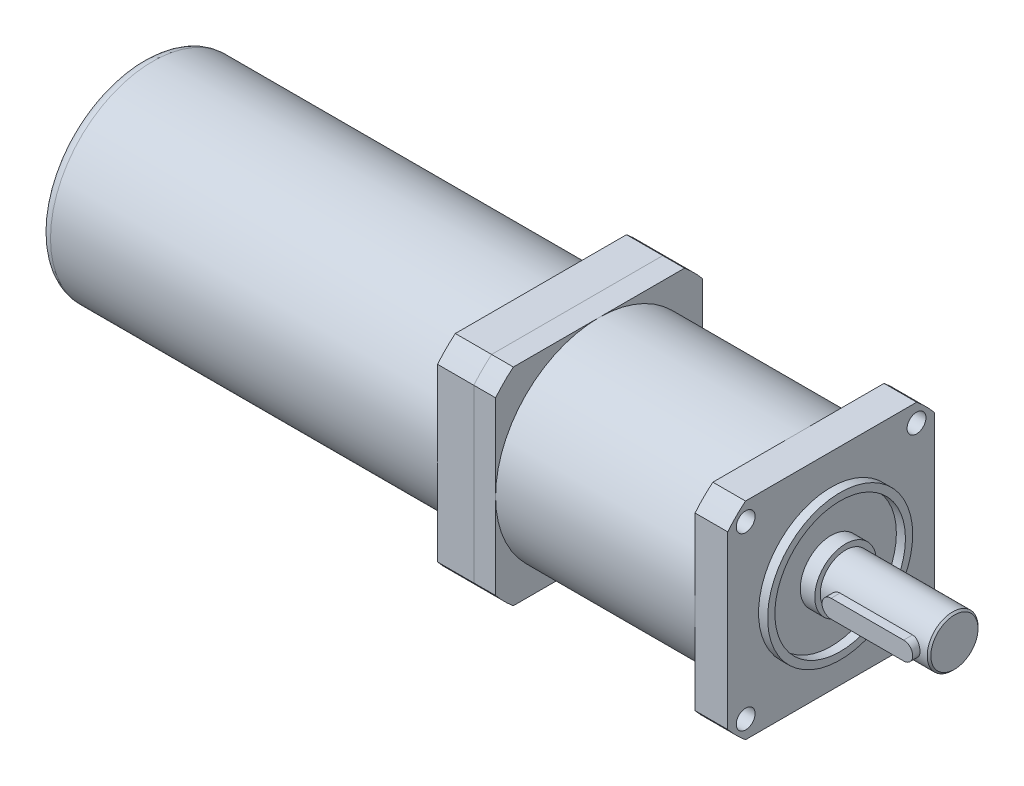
ISO-10303-21;
HEADER;
FILE_DESCRIPTION(('STEP AP214'),'2;1');
FILE_NAME('part.step','',(''),(''),'','','');
FILE_SCHEMA(('AUTOMOTIVE_DESIGN { 1 0 10303 214 1 1 1 1 }'));
ENDSEC;
DATA;
#1=APPLICATION_CONTEXT('core data for automotive mechanical design processes');
#2=APPLICATION_PROTOCOL_DEFINITION('international standard','automotive_design',2000,#1);
#3=PRODUCT_CONTEXT('',#1,'mechanical');
#4=PRODUCT('Part','Part','',(#3));
#5=PRODUCT_RELATED_PRODUCT_CATEGORY('part','',(#4));
#6=PRODUCT_DEFINITION_FORMATION('','',#4);
#7=PRODUCT_DEFINITION_CONTEXT('part definition',#1,'design');
#8=PRODUCT_DEFINITION('design','',#6,#7);
#9=PRODUCT_DEFINITION_SHAPE('','',#8);
#10=(LENGTH_UNIT() NAMED_UNIT(*) SI_UNIT(.MILLI.,.METRE.));
#11=(NAMED_UNIT(*) PLANE_ANGLE_UNIT() SI_UNIT($,.RADIAN.));
#12=(NAMED_UNIT(*) SI_UNIT($,.STERADIAN.) SOLID_ANGLE_UNIT());
#13=UNCERTAINTY_MEASURE_WITH_UNIT(LENGTH_MEASURE(1.E-05),#10,'distance_accuracy_value','');
#14=(GEOMETRIC_REPRESENTATION_CONTEXT(3) GLOBAL_UNCERTAINTY_ASSIGNED_CONTEXT((#13)) GLOBAL_UNIT_ASSIGNED_CONTEXT((#10,
#11,#12)) REPRESENTATION_CONTEXT('',''));
#15=CARTESIAN_POINT('',(0.,0.,0.));
#16=DIRECTION('',(0.,0.,1.));
#17=DIRECTION('',(1.,0.,0.));
#18=AXIS2_PLACEMENT_3D('',#15,#16,#17);
#19=CARTESIAN_POINT('',(-80.,0.,0.));
#20=DIRECTION('',(-1.,0.,0.));
#21=DIRECTION('',(0.,0.,1.));
#22=AXIS2_PLACEMENT_3D('',#19,#20,#21);
#23=PLANE('',#22);
#24=CARTESIAN_POINT('',(-80.,0.,0.));
#25=DIRECTION('',(-1.,0.,0.));
#26=DIRECTION('',(0.,0.,1.));
#27=AXIS2_PLACEMENT_3D('',#24,#25,#26);
#28=CIRCLE('',#27,37.);
#29=CARTESIAN_POINT('',(-80.,28.5,-23.5955504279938));
#30=VERTEX_POINT('',#29);
#31=CARTESIAN_POINT('',(-80.,23.5955504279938,-28.5));
#32=VERTEX_POINT('',#31);
#33=EDGE_CURVE('E158',#30,#32,#28,.T.);
#34=ORIENTED_EDGE('',*,*,#33,.T.);
#35=DIRECTION('',(0.,-1.,0.));
#36=VECTOR('',#35,1.);
#37=CARTESIAN_POINT('',(-80.,-23.5955504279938,-28.5));
#38=LINE('',#37,#36);
#39=CARTESIAN_POINT('',(-80.,-23.5955504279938,-28.5));
#40=VERTEX_POINT('',#39);
#41=EDGE_CURVE('E106',#32,#40,#38,.T.);
#42=ORIENTED_EDGE('',*,*,#41,.T.);
#43=CARTESIAN_POINT('',(-80.,0.,0.));
#44=DIRECTION('',(-1.,0.,0.));
#45=DIRECTION('',(0.,0.,1.));
#46=AXIS2_PLACEMENT_3D('',#43,#44,#45);
#47=CIRCLE('',#46,37.);
#48=CARTESIAN_POINT('',(-80.,-28.5,-23.5955504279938));
#49=VERTEX_POINT('',#48);
#50=EDGE_CURVE('E226',#40,#49,#47,.T.);
#51=ORIENTED_EDGE('',*,*,#50,.T.);
#52=DIRECTION('',(0.,0.,1.));
#53=VECTOR('',#52,1.);
#54=CARTESIAN_POINT('',(-80.,-28.5,-23.5955504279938));
#55=LINE('',#54,#53);
#56=CARTESIAN_POINT('',(-80.,-28.5,23.5955504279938));
#57=VERTEX_POINT('',#56);
#58=EDGE_CURVE('E231',#49,#57,#55,.T.);
#59=ORIENTED_EDGE('',*,*,#58,.T.);
#60=CARTESIAN_POINT('',(-80.,0.,0.));
#61=DIRECTION('',(-1.,0.,0.));
#62=DIRECTION('',(0.,0.,1.));
#63=AXIS2_PLACEMENT_3D('',#60,#61,#62);
#64=CIRCLE('',#63,37.);
#65=CARTESIAN_POINT('',(-80.,-23.5955504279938,28.5));
#66=VERTEX_POINT('',#65);
#67=EDGE_CURVE('E125',#57,#66,#64,.T.);
#68=ORIENTED_EDGE('',*,*,#67,.T.);
#69=DIRECTION('',(0.,1.,0.));
#70=VECTOR('',#69,1.);
#71=CARTESIAN_POINT('',(-80.,-23.5955504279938,28.5));
#72=LINE('',#71,#70);
#73=CARTESIAN_POINT('',(-80.,23.5955504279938,28.5));
#74=VERTEX_POINT('',#73);
#75=EDGE_CURVE('E119',#66,#74,#72,.T.);
#76=ORIENTED_EDGE('',*,*,#75,.T.);
#77=CARTESIAN_POINT('',(-80.,0.,0.));
#78=DIRECTION('',(-1.,0.,0.));
#79=DIRECTION('',(0.,0.,1.));
#80=AXIS2_PLACEMENT_3D('',#77,#78,#79);
#81=CIRCLE('',#80,37.);
#82=CARTESIAN_POINT('',(-80.,28.5,23.5955504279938));
#83=VERTEX_POINT('',#82);
#84=EDGE_CURVE('E123',#74,#83,#81,.T.);
#85=ORIENTED_EDGE('',*,*,#84,.T.);
#86=DIRECTION('',(0.,0.,-1.));
#87=VECTOR('',#86,1.);
#88=CARTESIAN_POINT('',(-80.,28.5,-23.5955504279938));
#89=LINE('',#88,#87);
#90=EDGE_CURVE('E62',#83,#30,#89,.T.);
#91=ORIENTED_EDGE('',*,*,#90,.T.);
#92=EDGE_LOOP('',(#34,#42,#51,#59,#68,#76,#85,#91));
#93=FACE_BOUND('',#92,.T.);
#94=CARTESIAN_POINT('',(-80.,0.,0.));
#95=DIRECTION('',(-1.,0.,0.));
#96=DIRECTION('',(0.,0.,1.));
#97=AXIS2_PLACEMENT_3D('',#94,#95,#96);
#98=CIRCLE('',#97,28.2);
#99=CARTESIAN_POINT('',(-80.,0.,28.2));
#100=VERTEX_POINT('',#99);
#101=EDGE_CURVE('E147',#100,#100,#98,.T.);
#102=ORIENTED_EDGE('',*,*,#101,.F.);
#103=EDGE_LOOP('',(#102));
#104=FACE_BOUND('',#103,.T.);
#105=ADVANCED_FACE('F45',(#93,#104),#23,.T.);
#106=CARTESIAN_POINT('',(-80.,0.,0.));
#107=DIRECTION('',(1.,0.,0.));
#108=DIRECTION('',(0.,0.,-1.));
#109=AXIS2_PLACEMENT_3D('',#106,#107,#108);
#110=CYLINDRICAL_SURFACE('',#109,37.);
#111=CARTESIAN_POINT('',(-70.,0.,0.));
#112=DIRECTION('',(-1.,0.,0.));
#113=DIRECTION('',(0.,0.,1.));
#114=AXIS2_PLACEMENT_3D('',#111,#112,#113);
#115=CIRCLE('',#114,37.);
#116=CARTESIAN_POINT('',(-70.,28.5,-23.5955504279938));
#117=VERTEX_POINT('',#116);
#118=CARTESIAN_POINT('',(-70.,23.5955504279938,-28.5));
#119=VERTEX_POINT('',#118);
#120=EDGE_CURVE('E143',#117,#119,#115,.T.);
#121=ORIENTED_EDGE('',*,*,#120,.T.);
#122=DIRECTION('',(1.,0.,0.));
#123=VECTOR('',#122,1.);
#124=CARTESIAN_POINT('',(-80.,23.5955504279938,-28.5));
#125=LINE('',#124,#123);
#126=EDGE_CURVE('E171',#32,#119,#125,.T.);
#127=ORIENTED_EDGE('',*,*,#126,.F.);
#128=ORIENTED_EDGE('',*,*,#33,.F.);
#129=DIRECTION('',(1.,0.,0.));
#130=VECTOR('',#129,1.);
#131=CARTESIAN_POINT('',(-80.,28.5,-23.5955504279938));
#132=LINE('',#131,#130);
#133=EDGE_CURVE('E139',#30,#117,#132,.T.);
#134=ORIENTED_EDGE('',*,*,#133,.T.);
#135=EDGE_LOOP('',(#121,#127,#128,#134));
#136=FACE_BOUND('',#135,.T.);
#137=ADVANCED_FACE('F186',(#136),#110,.T.);
#138=CARTESIAN_POINT('',(-80.,-23.5955504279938,-28.5));
#139=DIRECTION('',(0.,0.,1.));
#140=DIRECTION('',(1.,0.,0.));
#141=AXIS2_PLACEMENT_3D('',#138,#139,#140);
#142=PLANE('',#141);
#143=DIRECTION('',(0.,-1.,0.));
#144=VECTOR('',#143,1.);
#145=CARTESIAN_POINT('',(-70.,-23.5955504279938,-28.5));
#146=LINE('',#145,#144);
#147=CARTESIAN_POINT('',(-70.,-23.5955504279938,-28.5));
#148=VERTEX_POINT('',#147);
#149=EDGE_CURVE('E146',#119,#148,#146,.T.);
#150=ORIENTED_EDGE('',*,*,#149,.T.);
#151=DIRECTION('',(1.,0.,0.));
#152=VECTOR('',#151,1.);
#153=CARTESIAN_POINT('',(-80.,-23.5955504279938,-28.5));
#154=LINE('',#153,#152);
#155=EDGE_CURVE('E168',#40,#148,#154,.T.);
#156=ORIENTED_EDGE('',*,*,#155,.F.);
#157=ORIENTED_EDGE('',*,*,#41,.F.);
#158=ORIENTED_EDGE('',*,*,#126,.T.);
#159=EDGE_LOOP('',(#150,#156,#157,#158));
#160=FACE_BOUND('',#159,.T.);
#161=ADVANCED_FACE('F191',(#160),#142,.F.);
#162=CARTESIAN_POINT('',(-80.,0.,0.));
#163=DIRECTION('',(1.,0.,0.));
#164=DIRECTION('',(0.,0.,-1.));
#165=AXIS2_PLACEMENT_3D('',#162,#163,#164);
#166=CYLINDRICAL_SURFACE('',#165,37.);
#167=CARTESIAN_POINT('',(-70.,0.,0.));
#168=DIRECTION('',(-1.,0.,0.));
#169=DIRECTION('',(0.,0.,1.));
#170=AXIS2_PLACEMENT_3D('',#167,#168,#169);
#171=CIRCLE('',#170,37.);
#172=CARTESIAN_POINT('',(-70.,-28.5,-23.5955504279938));
#173=VERTEX_POINT('',#172);
#174=EDGE_CURVE('E149',#148,#173,#171,.T.);
#175=ORIENTED_EDGE('',*,*,#174,.T.);
#176=DIRECTION('',(1.,0.,0.));
#177=VECTOR('',#176,1.);
#178=CARTESIAN_POINT('',(-80.,-28.5,-23.5955504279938));
#179=LINE('',#178,#177);
#180=EDGE_CURVE('E165',#49,#173,#179,.T.);
#181=ORIENTED_EDGE('',*,*,#180,.F.);
#182=ORIENTED_EDGE('',*,*,#50,.F.);
#183=ORIENTED_EDGE('',*,*,#155,.T.);
#184=EDGE_LOOP('',(#175,#181,#182,#183));
#185=FACE_BOUND('',#184,.T.);
#186=ADVANCED_FACE('F213',(#185),#166,.T.);
#187=CARTESIAN_POINT('',(-80.,-28.5,-23.5955504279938));
#188=DIRECTION('',(0.,1.,0.));
#189=DIRECTION('',(0.,0.,1.));
#190=AXIS2_PLACEMENT_3D('',#187,#188,#189);
#191=PLANE('',#190);
#192=DIRECTION('',(0.,0.,1.));
#193=VECTOR('',#192,1.);
#194=CARTESIAN_POINT('',(-70.,-28.5,-23.5955504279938));
#195=LINE('',#194,#193);
#196=CARTESIAN_POINT('',(-70.,-28.5,23.5955504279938));
#197=VERTEX_POINT('',#196);
#198=EDGE_CURVE('E151',#173,#197,#195,.T.);
#199=ORIENTED_EDGE('',*,*,#198,.T.);
#200=DIRECTION('',(1.,0.,0.));
#201=VECTOR('',#200,1.);
#202=CARTESIAN_POINT('',(-80.,-28.5,23.5955504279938));
#203=LINE('',#202,#201);
#204=EDGE_CURVE('E162',#57,#197,#203,.T.);
#205=ORIENTED_EDGE('',*,*,#204,.F.);
#206=ORIENTED_EDGE('',*,*,#58,.F.);
#207=ORIENTED_EDGE('',*,*,#180,.T.);
#208=EDGE_LOOP('',(#199,#205,#206,#207));
#209=FACE_BOUND('',#208,.T.);
#210=ADVANCED_FACE('F209',(#209),#191,.F.);
#211=CARTESIAN_POINT('',(-80.,0.,0.));
#212=DIRECTION('',(1.,0.,0.));
#213=DIRECTION('',(0.,0.,-1.));
#214=AXIS2_PLACEMENT_3D('',#211,#212,#213);
#215=CYLINDRICAL_SURFACE('',#214,37.);
#216=CARTESIAN_POINT('',(-70.,0.,0.));
#217=DIRECTION('',(-1.,0.,0.));
#218=DIRECTION('',(0.,0.,1.));
#219=AXIS2_PLACEMENT_3D('',#216,#217,#218);
#220=CIRCLE('',#219,37.);
#221=CARTESIAN_POINT('',(-70.,-23.5955504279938,28.5));
#222=VERTEX_POINT('',#221);
#223=EDGE_CURVE('E153',#197,#222,#220,.T.);
#224=ORIENTED_EDGE('',*,*,#223,.T.);
#225=DIRECTION('',(1.,0.,0.));
#226=VECTOR('',#225,1.);
#227=CARTESIAN_POINT('',(-80.,-23.5955504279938,28.5));
#228=LINE('',#227,#226);
#229=EDGE_CURVE('E134',#66,#222,#228,.T.);
#230=ORIENTED_EDGE('',*,*,#229,.F.);
#231=ORIENTED_EDGE('',*,*,#67,.F.);
#232=ORIENTED_EDGE('',*,*,#204,.T.);
#233=EDGE_LOOP('',(#224,#230,#231,#232));
#234=FACE_BOUND('',#233,.T.);
#235=ADVANCED_FACE('F206',(#234),#215,.T.);
#236=CARTESIAN_POINT('',(-80.,-23.5955504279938,28.5));
#237=DIRECTION('',(0.,0.,-1.));
#238=DIRECTION('',(-1.,0.,0.));
#239=AXIS2_PLACEMENT_3D('',#236,#237,#238);
#240=PLANE('',#239);
#241=DIRECTION('',(0.,1.,0.));
#242=VECTOR('',#241,1.);
#243=CARTESIAN_POINT('',(-70.,-23.5955504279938,28.5));
#244=LINE('',#243,#242);
#245=CARTESIAN_POINT('',(-70.,23.5955504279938,28.5));
#246=VERTEX_POINT('',#245);
#247=EDGE_CURVE('E133',#222,#246,#244,.T.);
#248=ORIENTED_EDGE('',*,*,#247,.T.);
#249=DIRECTION('',(1.,0.,0.));
#250=VECTOR('',#249,1.);
#251=CARTESIAN_POINT('',(-80.,23.5955504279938,28.5));
#252=LINE('',#251,#250);
#253=EDGE_CURVE('E130',#74,#246,#252,.T.);
#254=ORIENTED_EDGE('',*,*,#253,.F.);
#255=ORIENTED_EDGE('',*,*,#75,.F.);
#256=ORIENTED_EDGE('',*,*,#229,.T.);
#257=EDGE_LOOP('',(#248,#254,#255,#256));
#258=FACE_BOUND('',#257,.T.);
#259=ADVANCED_FACE('F131',(#258),#240,.F.);
#260=CARTESIAN_POINT('',(-80.,0.,0.));
#261=DIRECTION('',(1.,0.,0.));
#262=DIRECTION('',(0.,0.,-1.));
#263=AXIS2_PLACEMENT_3D('',#260,#261,#262);
#264=CYLINDRICAL_SURFACE('',#263,37.);
#265=CARTESIAN_POINT('',(-70.,0.,0.));
#266=DIRECTION('',(-1.,0.,0.));
#267=DIRECTION('',(0.,0.,1.));
#268=AXIS2_PLACEMENT_3D('',#265,#266,#267);
#269=CIRCLE('',#268,37.);
#270=CARTESIAN_POINT('',(-70.,28.5,23.5955504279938));
#271=VERTEX_POINT('',#270);
#272=EDGE_CURVE('E91',#246,#271,#269,.T.);
#273=ORIENTED_EDGE('',*,*,#272,.T.);
#274=DIRECTION('',(1.,0.,0.));
#275=VECTOR('',#274,1.);
#276=CARTESIAN_POINT('',(-80.,28.5,23.5955504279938));
#277=LINE('',#276,#275);
#278=EDGE_CURVE('E135',#83,#271,#277,.T.);
#279=ORIENTED_EDGE('',*,*,#278,.F.);
#280=ORIENTED_EDGE('',*,*,#84,.F.);
#281=ORIENTED_EDGE('',*,*,#253,.T.);
#282=EDGE_LOOP('',(#273,#279,#280,#281));
#283=FACE_BOUND('',#282,.T.);
#284=ADVANCED_FACE('F137',(#283),#264,.T.);
#285=CARTESIAN_POINT('',(-80.,28.5,-23.5955504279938));
#286=DIRECTION('',(0.,-1.,0.));
#287=DIRECTION('',(0.,0.,-1.));
#288=AXIS2_PLACEMENT_3D('',#285,#286,#287);
#289=PLANE('',#288);
#290=DIRECTION('',(0.,0.,-1.));
#291=VECTOR('',#290,1.);
#292=CARTESIAN_POINT('',(-70.,28.5,-23.5955504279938));
#293=LINE('',#292,#291);
#294=EDGE_CURVE('E97',#271,#117,#293,.T.);
#295=ORIENTED_EDGE('',*,*,#294,.T.);
#296=ORIENTED_EDGE('',*,*,#133,.F.);
#297=ORIENTED_EDGE('',*,*,#90,.F.);
#298=ORIENTED_EDGE('',*,*,#278,.T.);
#299=EDGE_LOOP('',(#295,#296,#297,#298));
#300=FACE_BOUND('',#299,.T.);
#301=ADVANCED_FACE('F198',(#300),#289,.F.);
#302=CARTESIAN_POINT('',(-70.,0.,0.));
#303=DIRECTION('',(-1.,0.,0.));
#304=DIRECTION('',(0.,0.,1.));
#305=AXIS2_PLACEMENT_3D('',#302,#303,#304);
#306=PLANE('',#305);
#307=ORIENTED_EDGE('',*,*,#120,.F.);
#308=ORIENTED_EDGE('',*,*,#294,.F.);
#309=ORIENTED_EDGE('',*,*,#272,.F.);
#310=ORIENTED_EDGE('',*,*,#247,.F.);
#311=ORIENTED_EDGE('',*,*,#223,.F.);
#312=ORIENTED_EDGE('',*,*,#198,.F.);
#313=ORIENTED_EDGE('',*,*,#174,.F.);
#314=ORIENTED_EDGE('',*,*,#149,.F.);
#315=EDGE_LOOP('',(#307,#308,#309,#310,#311,#312,#313,#314));
#316=FACE_BOUND('',#315,.T.);
#317=ADVANCED_FACE('F195',(#316),#306,.F.);
#318=CARTESIAN_POINT('',(-190.,0.,0.));
#319=DIRECTION('',(1.,0.,0.));
#320=DIRECTION('',(0.,0.,-1.));
#321=AXIS2_PLACEMENT_3D('',#318,#319,#320);
#322=CYLINDRICAL_SURFACE('',#321,28.2);
#323=CARTESIAN_POINT('',(-187.,0.,0.));
#324=DIRECTION('',(-1.,0.,0.));
#325=DIRECTION('',(0.,0.,1.));
#326=AXIS2_PLACEMENT_3D('',#323,#324,#325);
#327=CIRCLE('',#326,28.2);
#328=CARTESIAN_POINT('',(-187.,0.,28.2));
#329=VERTEX_POINT('',#328);
#330=EDGE_CURVE('E12',#329,#329,#327,.F.);
#331=ORIENTED_EDGE('',*,*,#330,.T.);
#332=EDGE_LOOP('',(#331));
#333=FACE_BOUND('',#332,.T.);
#334=ORIENTED_EDGE('',*,*,#101,.T.);
#335=EDGE_LOOP('',(#334));
#336=FACE_BOUND('',#335,.T.);
#337=ADVANCED_FACE('F182',(#333,#336),#322,.T.);
#338=CARTESIAN_POINT('',(-190.,0.,0.));
#339=DIRECTION('',(-1.,0.,0.));
#340=DIRECTION('',(0.,0.,1.));
#341=AXIS2_PLACEMENT_3D('',#338,#339,#340);
#342=PLANE('',#341);
#343=CARTESIAN_POINT('',(-190.,0.,0.));
#344=DIRECTION('',(-1.,0.,0.));
#345=DIRECTION('',(0.,0.,1.));
#346=AXIS2_PLACEMENT_3D('',#343,#344,#345);
#347=CIRCLE('',#346,25.2);
#348=CARTESIAN_POINT('',(-190.,0.,25.2));
#349=VERTEX_POINT('',#348);
#350=EDGE_CURVE('E54',#349,#349,#347,.T.);
#351=ORIENTED_EDGE('',*,*,#350,.T.);
#352=EDGE_LOOP('',(#351));
#353=FACE_BOUND('',#352,.T.);
#354=ADVANCED_FACE('F175',(#353),#342,.T.);
#355=CARTESIAN_POINT('',(-187.,0.,0.));
#356=DIRECTION('',(-1.,0.,0.));
#357=DIRECTION('',(0.,0.,1.));
#358=AXIS2_PLACEMENT_3D('',#355,#356,#357);
#359=TOROIDAL_SURFACE('',#358,25.2,3.);
#360=ORIENTED_EDGE('',*,*,#330,.F.);
#361=EDGE_LOOP('',(#360));
#362=FACE_BOUND('',#361,.T.);
#363=ORIENTED_EDGE('',*,*,#350,.F.);
#364=EDGE_LOOP('',(#363));
#365=FACE_BOUND('',#364,.T.);
#366=ADVANCED_FACE('F47',(#362,#365),#359,.T.);
#367=CLOSED_SHELL('',(#105,#137,#161,#186,#210,#235,#259,#284,#301,#317,#337,#354,#366));
#368=MANIFOLD_SOLID_BREP('B2',#367);
#369=CARTESIAN_POINT('',(4.,0.,0.));
#370=DIRECTION('',(1.,0.,0.));
#371=DIRECTION('',(0.,0.,-1.));
#372=AXIS2_PLACEMENT_3D('',#369,#370,#371);
#373=PLANE('',#372);
#374=CARTESIAN_POINT('',(4.,0.,0.));
#375=DIRECTION('',(1.,0.,0.));
#376=DIRECTION('',(0.,0.,-1.));
#377=AXIS2_PLACEMENT_3D('',#374,#375,#376);
#378=CIRCLE('',#377,8.5);
#379=CARTESIAN_POINT('',(4.,0.,-8.5));
#380=VERTEX_POINT('',#379);
#381=EDGE_CURVE('E510',#380,#380,#378,.T.);
#382=ORIENTED_EDGE('',*,*,#381,.T.);
#383=EDGE_LOOP('',(#382));
#384=FACE_BOUND('',#383,.T.);
#385=CARTESIAN_POINT('',(4.,0.,0.));
#386=DIRECTION('',(1.,0.,0.));
#387=DIRECTION('',(0.,0.,-1.));
#388=AXIS2_PLACEMENT_3D('',#385,#386,#387);
#389=CIRCLE('',#388,7.);
#390=CARTESIAN_POINT('',(4.,0.,-7.));
#391=VERTEX_POINT('',#390);
#392=EDGE_CURVE('E501',#391,#391,#389,.T.);
#393=ORIENTED_EDGE('',*,*,#392,.F.);
#394=EDGE_LOOP('',(#393));
#395=FACE_BOUND('',#394,.T.);
#396=ADVANCED_FACE('F318',(#384,#395),#373,.T.);
#397=CARTESIAN_POINT('',(0.,0.,0.));
#398=DIRECTION('',(1.,0.,0.));
#399=DIRECTION('',(0.,0.,-1.));
#400=AXIS2_PLACEMENT_3D('',#397,#398,#399);
#401=PLANE('',#400);
#402=CARTESIAN_POINT('',(0.,0.,0.));
#403=DIRECTION('',(1.,0.,0.));
#404=DIRECTION('',(0.,0.,-1.));
#405=AXIS2_PLACEMENT_3D('',#402,#403,#404);
#406=CIRCLE('',#405,18.);
#407=CARTESIAN_POINT('',(0.,0.,-18.));
#408=VERTEX_POINT('',#407);
#409=EDGE_CURVE('E690',#408,#408,#406,.F.);
#410=ORIENTED_EDGE('',*,*,#409,.F.);
#411=EDGE_LOOP('',(#410));
#412=FACE_BOUND('',#411,.T.);
#413=CARTESIAN_POINT('',(0.,0.,0.));
#414=DIRECTION('',(1.,0.,0.));
#415=DIRECTION('',(0.,0.,-1.));
#416=AXIS2_PLACEMENT_3D('',#413,#414,#415);
#417=CIRCLE('',#416,8.5);
#418=CARTESIAN_POINT('',(0.,0.,-8.5));
#419=VERTEX_POINT('',#418);
#420=EDGE_CURVE('E504',#419,#419,#417,.T.);
#421=ORIENTED_EDGE('',*,*,#420,.F.);
#422=EDGE_LOOP('',(#421));
#423=FACE_BOUND('',#422,.T.);
#424=ADVANCED_FACE('F725',(#412,#423),#401,.T.);
#425=CARTESIAN_POINT('',(0.,-23.55,23.55));
#426=DIRECTION('',(1.,0.,0.));
#427=DIRECTION('',(0.,0.,-1.));
#428=AXIS2_PLACEMENT_3D('',#425,#426,#427);
#429=CIRCLE('',#428,2.6);
#430=CARTESIAN_POINT('',(0.,-23.55,20.95));
#431=VERTEX_POINT('',#430);
#432=EDGE_CURVE('E522',#431,#431,#429,.T.);
#433=ORIENTED_EDGE('',*,*,#432,.F.);
#434=EDGE_LOOP('',(#433));
#435=FACE_BOUND('',#434,.T.);
#436=CARTESIAN_POINT('',(0.,-23.55,-23.55));
#437=DIRECTION('',(1.,0.,0.));
#438=DIRECTION('',(0.,0.,-1.));
#439=AXIS2_PLACEMENT_3D('',#436,#437,#438);
#440=CIRCLE('',#439,2.6);
#441=CARTESIAN_POINT('',(0.,-23.55,-26.15));
#442=VERTEX_POINT('',#441);
#443=EDGE_CURVE('E528',#442,#442,#440,.T.);
#444=ORIENTED_EDGE('',*,*,#443,.F.);
#445=EDGE_LOOP('',(#444));
#446=FACE_BOUND('',#445,.T.);
#447=CARTESIAN_POINT('',(0.,23.55,-23.55));
#448=DIRECTION('',(1.,0.,0.));
#449=DIRECTION('',(0.,0.,-1.));
#450=AXIS2_PLACEMENT_3D('',#447,#448,#449);
#451=CIRCLE('',#450,2.6);
#452=CARTESIAN_POINT('',(0.,23.55,-26.15));
#453=VERTEX_POINT('',#452);
#454=EDGE_CURVE('E534',#453,#453,#451,.T.);
#455=ORIENTED_EDGE('',*,*,#454,.F.);
#456=EDGE_LOOP('',(#455));
#457=FACE_BOUND('',#456,.T.);
#458=CARTESIAN_POINT('',(0.,23.55,23.55));
#459=DIRECTION('',(1.,0.,0.));
#460=DIRECTION('',(0.,0.,-1.));
#461=AXIS2_PLACEMENT_3D('',#458,#459,#460);
#462=CIRCLE('',#461,2.6);
#463=CARTESIAN_POINT('',(0.,23.55,20.95));
#464=VERTEX_POINT('',#463);
#465=EDGE_CURVE('E540',#464,#464,#462,.T.);
#466=ORIENTED_EDGE('',*,*,#465,.F.);
#467=EDGE_LOOP('',(#466));
#468=FACE_BOUND('',#467,.T.);
#469=CARTESIAN_POINT('',(0.,0.,0.));
#470=DIRECTION('',(1.,0.,0.));
#471=DIRECTION('',(0.,0.,-1.));
#472=AXIS2_PLACEMENT_3D('',#469,#470,#471);
#473=CIRCLE('',#472,37.);
#474=CARTESIAN_POINT('',(0.,23.5955504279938,-28.5));
#475=VERTEX_POINT('',#474);
#476=CARTESIAN_POINT('',(0.,28.5,-23.5955504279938));
#477=VERTEX_POINT('',#476);
#478=EDGE_CURVE('E618',#475,#477,#473,.T.);
#479=ORIENTED_EDGE('',*,*,#478,.T.);
#480=DIRECTION('',(0.,0.,1.));
#481=VECTOR('',#480,1.);
#482=CARTESIAN_POINT('',(0.,28.5,23.5955504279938));
#483=LINE('',#482,#481);
#484=CARTESIAN_POINT('',(0.,28.5,23.5955504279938));
#485=VERTEX_POINT('',#484);
#486=EDGE_CURVE('E655',#477,#485,#483,.T.);
#487=ORIENTED_EDGE('',*,*,#486,.T.);
#488=CARTESIAN_POINT('',(0.,0.,0.));
#489=DIRECTION('',(1.,0.,0.));
#490=DIRECTION('',(0.,0.,-1.));
#491=AXIS2_PLACEMENT_3D('',#488,#489,#490);
#492=CIRCLE('',#491,37.);
#493=CARTESIAN_POINT('',(0.,23.5955504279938,28.5));
#494=VERTEX_POINT('',#493);
#495=EDGE_CURVE('E658',#485,#494,#492,.T.);
#496=ORIENTED_EDGE('',*,*,#495,.T.);
#497=DIRECTION('',(0.,-1.,0.));
#498=VECTOR('',#497,1.);
#499=CARTESIAN_POINT('',(0.,-23.5955504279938,28.5));
#500=LINE('',#499,#498);
#501=CARTESIAN_POINT('',(0.,-23.5955504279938,28.5));
#502=VERTEX_POINT('',#501);
#503=EDGE_CURVE('E661',#494,#502,#500,.T.);
#504=ORIENTED_EDGE('',*,*,#503,.T.);
#505=CARTESIAN_POINT('',(0.,0.,0.));
#506=DIRECTION('',(1.,0.,0.));
#507=DIRECTION('',(0.,0.,-1.));
#508=AXIS2_PLACEMENT_3D('',#505,#506,#507);
#509=CIRCLE('',#508,37.);
#510=CARTESIAN_POINT('',(0.,-28.5,23.5955504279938));
#511=VERTEX_POINT('',#510);
#512=EDGE_CURVE('E664',#502,#511,#509,.T.);
#513=ORIENTED_EDGE('',*,*,#512,.T.);
#514=DIRECTION('',(0.,0.,-1.));
#515=VECTOR('',#514,1.);
#516=CARTESIAN_POINT('',(0.,-28.5,23.5955504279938));
#517=LINE('',#516,#515);
#518=CARTESIAN_POINT('',(0.,-28.5,-23.5955504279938));
#519=VERTEX_POINT('',#518);
#520=EDGE_CURVE('E667',#511,#519,#517,.T.);
#521=ORIENTED_EDGE('',*,*,#520,.T.);
#522=CARTESIAN_POINT('',(0.,0.,0.));
#523=DIRECTION('',(1.,0.,0.));
#524=DIRECTION('',(0.,0.,-1.));
#525=AXIS2_PLACEMENT_3D('',#522,#523,#524);
#526=CIRCLE('',#525,37.);
#527=CARTESIAN_POINT('',(0.,-23.5955504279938,-28.5));
#528=VERTEX_POINT('',#527);
#529=EDGE_CURVE('E670',#519,#528,#526,.T.);
#530=ORIENTED_EDGE('',*,*,#529,.T.);
#531=DIRECTION('',(0.,1.,0.));
#532=VECTOR('',#531,1.);
#533=CARTESIAN_POINT('',(0.,-23.5955504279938,-28.5));
#534=LINE('',#533,#532);
#535=EDGE_CURVE('E628',#528,#475,#534,.T.);
#536=ORIENTED_EDGE('',*,*,#535,.T.);
#537=EDGE_LOOP('',(#479,#487,#496,#504,#513,#521,#530,#536));
#538=FACE_BOUND('',#537,.T.);
#539=CARTESIAN_POINT('',(0.,0.,0.));
#540=DIRECTION('',(1.,0.,0.));
#541=DIRECTION('',(0.,0.,-1.));
#542=AXIS2_PLACEMENT_3D('',#539,#540,#541);
#543=CIRCLE('',#542,20.);
#544=CARTESIAN_POINT('',(0.,0.,-20.));
#545=VERTEX_POINT('',#544);
#546=EDGE_CURVE('E518',#545,#545,#543,.T.);
#547=ORIENTED_EDGE('',*,*,#546,.F.);
#548=EDGE_LOOP('',(#547));
#549=FACE_BOUND('',#548,.T.);
#550=ADVANCED_FACE('F730',(#435,#446,#457,#468,#538,#549),#401,.T.);
#551=CARTESIAN_POINT('',(-9.,0.,0.));
#552=DIRECTION('',(1.,0.,0.));
#553=DIRECTION('',(0.,0.,-1.));
#554=AXIS2_PLACEMENT_3D('',#551,#552,#553);
#555=PLANE('',#554);
#556=CARTESIAN_POINT('',(-9.,23.55,23.55));
#557=DIRECTION('',(1.,0.,0.));
#558=DIRECTION('',(0.,0.,-1.));
#559=AXIS2_PLACEMENT_3D('',#556,#557,#558);
#560=CIRCLE('',#559,2.6);
#561=CARTESIAN_POINT('',(-9.,23.55,20.95));
#562=VERTEX_POINT('',#561);
#563=EDGE_CURVE('E543',#562,#562,#560,.T.);
#564=ORIENTED_EDGE('',*,*,#563,.T.);
#565=EDGE_LOOP('',(#564));
#566=FACE_BOUND('',#565,.T.);
#567=CARTESIAN_POINT('',(-9.,0.,0.));
#568=DIRECTION('',(-1.,0.,0.));
#569=DIRECTION('',(0.,0.,1.));
#570=AXIS2_PLACEMENT_3D('',#567,#568,#569);
#571=CIRCLE('',#570,28.5);
#572=CARTESIAN_POINT('',(-9.,0.,28.5));
#573=VERTEX_POINT('',#572);
#574=CARTESIAN_POINT('',(-9.,28.5,0.));
#575=VERTEX_POINT('',#574);
#576=EDGE_CURVE('E614',#573,#575,#571,.T.);
#577=ORIENTED_EDGE('',*,*,#576,.F.);
#578=DIRECTION('',(0.,-1.,0.));
#579=VECTOR('',#578,1.);
#580=CARTESIAN_POINT('',(-9.,-23.5955504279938,28.5));
#581=LINE('',#580,#579);
#582=CARTESIAN_POINT('',(-9.,23.5955504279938,28.5));
#583=VERTEX_POINT('',#582);
#584=EDGE_CURVE('E636',#583,#573,#581,.T.);
#585=ORIENTED_EDGE('',*,*,#584,.F.);
#586=CARTESIAN_POINT('',(-9.,0.,0.));
#587=DIRECTION('',(1.,0.,0.));
#588=DIRECTION('',(0.,0.,-1.));
#589=AXIS2_PLACEMENT_3D('',#586,#587,#588);
#590=CIRCLE('',#589,37.);
#591=CARTESIAN_POINT('',(-9.,28.5,23.5955504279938));
#592=VERTEX_POINT('',#591);
#593=EDGE_CURVE('E632',#592,#583,#590,.T.);
#594=ORIENTED_EDGE('',*,*,#593,.F.);
#595=DIRECTION('',(0.,0.,1.));
#596=VECTOR('',#595,1.);
#597=CARTESIAN_POINT('',(-9.,28.5,23.5955504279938));
#598=LINE('',#597,#596);
#599=EDGE_CURVE('E627',#575,#592,#598,.T.);
#600=ORIENTED_EDGE('',*,*,#599,.F.);
#601=EDGE_LOOP('',(#577,#585,#594,#600));
#602=FACE_BOUND('',#601,.T.);
#603=ADVANCED_FACE('F812',(#566,#602),#555,.F.);
#604=CARTESIAN_POINT('',(-9.,23.55,-23.55));
#605=DIRECTION('',(1.,0.,0.));
#606=DIRECTION('',(0.,0.,-1.));
#607=AXIS2_PLACEMENT_3D('',#604,#605,#606);
#608=CIRCLE('',#607,2.6);
#609=CARTESIAN_POINT('',(-9.,23.55,-26.15));
#610=VERTEX_POINT('',#609);
#611=EDGE_CURVE('E537',#610,#610,#608,.T.);
#612=ORIENTED_EDGE('',*,*,#611,.T.);
#613=EDGE_LOOP('',(#612));
#614=FACE_BOUND('',#613,.T.);
#615=CARTESIAN_POINT('',(-9.,0.,-28.5));
#616=VERTEX_POINT('',#615);
#617=EDGE_CURVE('E622',#575,#616,#571,.T.);
#618=ORIENTED_EDGE('',*,*,#617,.F.);
#619=CARTESIAN_POINT('',(-9.,28.5,-23.5955504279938));
#620=VERTEX_POINT('',#619);
#621=EDGE_CURVE('E629',#620,#575,#598,.T.);
#622=ORIENTED_EDGE('',*,*,#621,.F.);
#623=CARTESIAN_POINT('',(-9.,0.,0.));
#624=DIRECTION('',(1.,0.,0.));
#625=DIRECTION('',(0.,0.,-1.));
#626=AXIS2_PLACEMENT_3D('',#623,#624,#625);
#627=CIRCLE('',#626,37.);
#628=CARTESIAN_POINT('',(-9.,23.5955504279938,-28.5));
#629=VERTEX_POINT('',#628);
#630=EDGE_CURVE('E624',#629,#620,#627,.T.);
#631=ORIENTED_EDGE('',*,*,#630,.F.);
#632=DIRECTION('',(0.,1.,0.));
#633=VECTOR('',#632,1.);
#634=CARTESIAN_POINT('',(-9.,-23.5955504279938,-28.5));
#635=LINE('',#634,#633);
#636=EDGE_CURVE('E648',#616,#629,#635,.T.);
#637=ORIENTED_EDGE('',*,*,#636,.F.);
#638=EDGE_LOOP('',(#618,#622,#631,#637));
#639=FACE_BOUND('',#638,.T.);
#640=ADVANCED_FACE('F814',(#614,#639),#555,.F.);
#641=CARTESIAN_POINT('',(-9.,-23.55,-23.55));
#642=DIRECTION('',(1.,0.,0.));
#643=DIRECTION('',(0.,0.,-1.));
#644=AXIS2_PLACEMENT_3D('',#641,#642,#643);
#645=CIRCLE('',#644,2.6);
#646=CARTESIAN_POINT('',(-9.,-23.55,-26.15));
#647=VERTEX_POINT('',#646);
#648=EDGE_CURVE('E531',#647,#647,#645,.T.);
#649=ORIENTED_EDGE('',*,*,#648,.T.);
#650=EDGE_LOOP('',(#649));
#651=FACE_BOUND('',#650,.T.);
#652=CARTESIAN_POINT('',(-9.,-28.5,0.));
#653=VERTEX_POINT('',#652);
#654=EDGE_CURVE('E886',#616,#653,#571,.T.);
#655=ORIENTED_EDGE('',*,*,#654,.F.);
#656=CARTESIAN_POINT('',(-9.,-23.5955504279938,-28.5));
#657=VERTEX_POINT('',#656);
#658=EDGE_CURVE('E649',#657,#616,#635,.T.);
#659=ORIENTED_EDGE('',*,*,#658,.F.);
#660=CARTESIAN_POINT('',(-9.,0.,0.));
#661=DIRECTION('',(1.,0.,0.));
#662=DIRECTION('',(0.,0.,-1.));
#663=AXIS2_PLACEMENT_3D('',#660,#661,#662);
#664=CIRCLE('',#663,37.);
#665=CARTESIAN_POINT('',(-9.,-28.5,-23.5955504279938));
#666=VERTEX_POINT('',#665);
#667=EDGE_CURVE('E645',#666,#657,#664,.T.);
#668=ORIENTED_EDGE('',*,*,#667,.F.);
#669=DIRECTION('',(0.,0.,-1.));
#670=VECTOR('',#669,1.);
#671=CARTESIAN_POINT('',(-9.,-28.5,23.5955504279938));
#672=LINE('',#671,#670);
#673=EDGE_CURVE('E641',#653,#666,#672,.T.);
#674=ORIENTED_EDGE('',*,*,#673,.F.);
#675=EDGE_LOOP('',(#655,#659,#668,#674));
#676=FACE_BOUND('',#675,.T.);
#677=ADVANCED_FACE('F850',(#651,#676),#555,.F.);
#678=CARTESIAN_POINT('',(-9.,-23.55,23.55));
#679=DIRECTION('',(1.,0.,0.));
#680=DIRECTION('',(0.,0.,-1.));
#681=AXIS2_PLACEMENT_3D('',#678,#679,#680);
#682=CIRCLE('',#681,2.6);
#683=CARTESIAN_POINT('',(-9.,-23.55,20.95));
#684=VERTEX_POINT('',#683);
#685=EDGE_CURVE('E525',#684,#684,#682,.T.);
#686=ORIENTED_EDGE('',*,*,#685,.T.);
#687=EDGE_LOOP('',(#686));
#688=FACE_BOUND('',#687,.T.);
#689=EDGE_CURVE('E623',#653,#573,#571,.T.);
#690=ORIENTED_EDGE('',*,*,#689,.F.);
#691=CARTESIAN_POINT('',(-9.,-28.5,23.5955504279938));
#692=VERTEX_POINT('',#691);
#693=EDGE_CURVE('E642',#692,#653,#672,.T.);
#694=ORIENTED_EDGE('',*,*,#693,.F.);
#695=CARTESIAN_POINT('',(-9.,0.,0.));
#696=DIRECTION('',(1.,0.,0.));
#697=DIRECTION('',(0.,0.,-1.));
#698=AXIS2_PLACEMENT_3D('',#695,#696,#697);
#699=CIRCLE('',#698,37.);
#700=CARTESIAN_POINT('',(-9.,-23.5955504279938,28.5));
#701=VERTEX_POINT('',#700);
#702=EDGE_CURVE('E638',#701,#692,#699,.T.);
#703=ORIENTED_EDGE('',*,*,#702,.F.);
#704=EDGE_CURVE('E635',#573,#701,#581,.T.);
#705=ORIENTED_EDGE('',*,*,#704,.F.);
#706=EDGE_LOOP('',(#690,#694,#703,#705));
#707=FACE_BOUND('',#706,.T.);
#708=ADVANCED_FACE('F816',(#688,#707),#555,.F.);
#709=CARTESIAN_POINT('',(-9.,0.,0.));
#710=DIRECTION('',(1.,0.,0.));
#711=DIRECTION('',(0.,0.,-1.));
#712=AXIS2_PLACEMENT_3D('',#709,#710,#711);
#713=CYLINDRICAL_SURFACE('',#712,37.);
#714=ORIENTED_EDGE('',*,*,#478,.F.);
#715=DIRECTION('',(1.,0.,0.));
#716=VECTOR('',#715,1.);
#717=CARTESIAN_POINT('',(-9.,23.5955504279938,-28.5));
#718=LINE('',#717,#716);
#719=EDGE_CURVE('E675',#629,#475,#718,.T.);
#720=ORIENTED_EDGE('',*,*,#719,.F.);
#721=ORIENTED_EDGE('',*,*,#630,.T.);
#722=DIRECTION('',(1.,0.,0.));
#723=VECTOR('',#722,1.);
#724=CARTESIAN_POINT('',(-9.,28.5,-23.5955504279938));
#725=LINE('',#724,#723);
#726=EDGE_CURVE('E652',#620,#477,#725,.T.);
#727=ORIENTED_EDGE('',*,*,#726,.T.);
#728=EDGE_LOOP('',(#714,#720,#721,#727));
#729=FACE_BOUND('',#728,.T.);
#730=ADVANCED_FACE('F822',(#729),#713,.T.);
#731=CARTESIAN_POINT('',(-9.,-23.5955504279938,-28.5));
#732=DIRECTION('',(0.,0.,-1.));
#733=DIRECTION('',(-1.,0.,0.));
#734=AXIS2_PLACEMENT_3D('',#731,#732,#733);
#735=PLANE('',#734);
#736=ORIENTED_EDGE('',*,*,#535,.F.);
#737=DIRECTION('',(1.,0.,0.));
#738=VECTOR('',#737,1.);
#739=CARTESIAN_POINT('',(-9.,-23.5955504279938,-28.5));
#740=LINE('',#739,#738);
#741=EDGE_CURVE('E677',#657,#528,#740,.T.);
#742=ORIENTED_EDGE('',*,*,#741,.F.);
#743=ORIENTED_EDGE('',*,*,#658,.T.);
#744=ORIENTED_EDGE('',*,*,#636,.T.);
#745=ORIENTED_EDGE('',*,*,#719,.T.);
#746=EDGE_LOOP('',(#736,#742,#743,#744,#745));
#747=FACE_BOUND('',#746,.T.);
#748=ADVANCED_FACE('F818',(#747),#735,.T.);
#749=CARTESIAN_POINT('',(-9.,0.,0.));
#750=DIRECTION('',(1.,0.,0.));
#751=DIRECTION('',(0.,0.,-1.));
#752=AXIS2_PLACEMENT_3D('',#749,#750,#751);
#753=CYLINDRICAL_SURFACE('',#752,37.);
#754=ORIENTED_EDGE('',*,*,#529,.F.);
#755=DIRECTION('',(1.,0.,0.));
#756=VECTOR('',#755,1.);
#757=CARTESIAN_POINT('',(-9.,-28.5,-23.5955504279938));
#758=LINE('',#757,#756);
#759=EDGE_CURVE('E679',#666,#519,#758,.T.);
#760=ORIENTED_EDGE('',*,*,#759,.F.);
#761=ORIENTED_EDGE('',*,*,#667,.T.);
#762=ORIENTED_EDGE('',*,*,#741,.T.);
#763=EDGE_LOOP('',(#754,#760,#761,#762));
#764=FACE_BOUND('',#763,.T.);
#765=ADVANCED_FACE('F821',(#764),#753,.T.);
#766=CARTESIAN_POINT('',(-9.,-28.5,23.5955504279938));
#767=DIRECTION('',(0.,-1.,0.));
#768=DIRECTION('',(0.,0.,-1.));
#769=AXIS2_PLACEMENT_3D('',#766,#767,#768);
#770=PLANE('',#769);
#771=ORIENTED_EDGE('',*,*,#520,.F.);
#772=DIRECTION('',(1.,0.,0.));
#773=VECTOR('',#772,1.);
#774=CARTESIAN_POINT('',(-9.,-28.5,23.5955504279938));
#775=LINE('',#774,#773);
#776=EDGE_CURVE('E681',#692,#511,#775,.T.);
#777=ORIENTED_EDGE('',*,*,#776,.F.);
#778=ORIENTED_EDGE('',*,*,#693,.T.);
#779=ORIENTED_EDGE('',*,*,#673,.T.);
#780=ORIENTED_EDGE('',*,*,#759,.T.);
#781=EDGE_LOOP('',(#771,#777,#778,#779,#780));
#782=FACE_BOUND('',#781,.T.);
#783=ADVANCED_FACE('F826',(#782),#770,.T.);
#784=CARTESIAN_POINT('',(-9.,0.,0.));
#785=DIRECTION('',(1.,0.,0.));
#786=DIRECTION('',(0.,0.,-1.));
#787=AXIS2_PLACEMENT_3D('',#784,#785,#786);
#788=CYLINDRICAL_SURFACE('',#787,37.);
#789=ORIENTED_EDGE('',*,*,#512,.F.);
#790=DIRECTION('',(1.,0.,0.));
#791=VECTOR('',#790,1.);
#792=CARTESIAN_POINT('',(-9.,-23.5955504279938,28.5));
#793=LINE('',#792,#791);
#794=EDGE_CURVE('E683',#701,#502,#793,.T.);
#795=ORIENTED_EDGE('',*,*,#794,.F.);
#796=ORIENTED_EDGE('',*,*,#702,.T.);
#797=ORIENTED_EDGE('',*,*,#776,.T.);
#798=EDGE_LOOP('',(#789,#795,#796,#797));
#799=FACE_BOUND('',#798,.T.);
#800=ADVANCED_FACE('F830',(#799),#788,.T.);
#801=CARTESIAN_POINT('',(-9.,-23.5955504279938,28.5));
#802=DIRECTION('',(0.,0.,1.));
#803=DIRECTION('',(1.,0.,0.));
#804=AXIS2_PLACEMENT_3D('',#801,#802,#803);
#805=PLANE('',#804);
#806=ORIENTED_EDGE('',*,*,#503,.F.);
#807=DIRECTION('',(1.,0.,0.));
#808=VECTOR('',#807,1.);
#809=CARTESIAN_POINT('',(-9.,23.5955504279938,28.5));
#810=LINE('',#809,#808);
#811=EDGE_CURVE('E685',#583,#494,#810,.T.);
#812=ORIENTED_EDGE('',*,*,#811,.F.);
#813=ORIENTED_EDGE('',*,*,#584,.T.);
#814=ORIENTED_EDGE('',*,*,#704,.T.);
#815=ORIENTED_EDGE('',*,*,#794,.T.);
#816=EDGE_LOOP('',(#806,#812,#813,#814,#815));
#817=FACE_BOUND('',#816,.T.);
#818=ADVANCED_FACE('F834',(#817),#805,.T.);
#819=CARTESIAN_POINT('',(-9.,0.,0.));
#820=DIRECTION('',(1.,0.,0.));
#821=DIRECTION('',(0.,0.,-1.));
#822=AXIS2_PLACEMENT_3D('',#819,#820,#821);
#823=CYLINDRICAL_SURFACE('',#822,37.);
#824=ORIENTED_EDGE('',*,*,#495,.F.);
#825=DIRECTION('',(1.,0.,0.));
#826=VECTOR('',#825,1.);
#827=CARTESIAN_POINT('',(-9.,28.5,23.5955504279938));
#828=LINE('',#827,#826);
#829=EDGE_CURVE('E687',#592,#485,#828,.T.);
#830=ORIENTED_EDGE('',*,*,#829,.F.);
#831=ORIENTED_EDGE('',*,*,#593,.T.);
#832=ORIENTED_EDGE('',*,*,#811,.T.);
#833=EDGE_LOOP('',(#824,#830,#831,#832));
#834=FACE_BOUND('',#833,.T.);
#835=ADVANCED_FACE('F838',(#834),#823,.T.);
#836=CARTESIAN_POINT('',(-9.,28.5,23.5955504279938));
#837=DIRECTION('',(0.,1.,0.));
#838=DIRECTION('',(0.,0.,1.));
#839=AXIS2_PLACEMENT_3D('',#836,#837,#838);
#840=PLANE('',#839);
#841=ORIENTED_EDGE('',*,*,#486,.F.);
#842=ORIENTED_EDGE('',*,*,#726,.F.);
#843=ORIENTED_EDGE('',*,*,#621,.T.);
#844=ORIENTED_EDGE('',*,*,#599,.T.);
#845=ORIENTED_EDGE('',*,*,#829,.T.);
#846=EDGE_LOOP('',(#841,#842,#843,#844,#845));
#847=FACE_BOUND('',#846,.T.);
#848=ADVANCED_FACE('F811',(#847),#840,.T.);
#849=CARTESIAN_POINT('',(-64.,0.,0.));
#850=DIRECTION('',(1.,0.,0.));
#851=DIRECTION('',(0.,0.,-1.));
#852=AXIS2_PLACEMENT_3D('',#849,#850,#851);
#853=CYLINDRICAL_SURFACE('',#852,28.5);
#854=CARTESIAN_POINT('',(-64.,0.,0.));
#855=DIRECTION('',(-1.,0.,0.));
#856=DIRECTION('',(0.,0.,1.));
#857=AXIS2_PLACEMENT_3D('',#854,#855,#856);
#858=CIRCLE('',#857,28.5);
#859=CARTESIAN_POINT('',(-64.,0.,28.5));
#860=VERTEX_POINT('',#859);
#861=CARTESIAN_POINT('',(-64.,28.5,0.));
#862=VERTEX_POINT('',#861);
#863=EDGE_CURVE('E615',#860,#862,#858,.T.);
#864=ORIENTED_EDGE('',*,*,#863,.F.);
#865=CARTESIAN_POINT('',(-64.,-28.5,0.));
#866=VERTEX_POINT('',#865);
#867=EDGE_CURVE('E333',#866,#860,#858,.T.);
#868=ORIENTED_EDGE('',*,*,#867,.F.);
#869=CARTESIAN_POINT('',(-64.,0.,-28.5));
#870=VERTEX_POINT('',#869);
#871=EDGE_CURVE('E337',#870,#866,#858,.T.);
#872=ORIENTED_EDGE('',*,*,#871,.F.);
#873=EDGE_CURVE('E619',#862,#870,#858,.T.);
#874=ORIENTED_EDGE('',*,*,#873,.F.);
#875=EDGE_LOOP('',(#864,#868,#872,#874));
#876=FACE_BOUND('',#875,.T.);
#877=ORIENTED_EDGE('',*,*,#576,.T.);
#878=ORIENTED_EDGE('',*,*,#617,.T.);
#879=ORIENTED_EDGE('',*,*,#654,.T.);
#880=ORIENTED_EDGE('',*,*,#689,.T.);
#881=EDGE_LOOP('',(#877,#878,#879,#880));
#882=FACE_BOUND('',#881,.T.);
#883=ADVANCED_FACE('F775',(#876,#882),#853,.T.);
#884=CARTESIAN_POINT('',(-64.,0.,0.));
#885=DIRECTION('',(-1.,0.,0.));
#886=DIRECTION('',(0.,0.,1.));
#887=AXIS2_PLACEMENT_3D('',#884,#885,#886);
#888=PLANE('',#887);
#889=DIRECTION('',(0.,1.,0.));
#890=VECTOR('',#889,1.);
#891=CARTESIAN_POINT('',(-64.,-23.5955504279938,28.5));
#892=LINE('',#891,#890);
#893=CARTESIAN_POINT('',(-64.,23.5955504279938,28.5));
#894=VERTEX_POINT('',#893);
#895=EDGE_CURVE('E576',#860,#894,#892,.T.);
#896=ORIENTED_EDGE('',*,*,#895,.F.);
#897=ORIENTED_EDGE('',*,*,#863,.T.);
#898=DIRECTION('',(0.,0.,-1.));
#899=VECTOR('',#898,1.);
#900=CARTESIAN_POINT('',(-64.,28.5,-23.5955504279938));
#901=LINE('',#900,#899);
#902=CARTESIAN_POINT('',(-64.,28.5,23.5955504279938));
#903=VERTEX_POINT('',#902);
#904=EDGE_CURVE('E583',#903,#862,#901,.T.);
#905=ORIENTED_EDGE('',*,*,#904,.F.);
#906=CARTESIAN_POINT('',(-64.,0.,0.));
#907=DIRECTION('',(-1.,0.,0.));
#908=DIRECTION('',(0.,0.,1.));
#909=AXIS2_PLACEMENT_3D('',#906,#907,#908);
#910=CIRCLE('',#909,37.);
#911=EDGE_CURVE('E580',#894,#903,#910,.T.);
#912=ORIENTED_EDGE('',*,*,#911,.F.);
#913=EDGE_LOOP('',(#896,#897,#905,#912));
#914=FACE_BOUND('',#913,.T.);
#915=ADVANCED_FACE('F771',(#914),#888,.F.);
#916=CARTESIAN_POINT('',(-64.,28.5,-23.5955504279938));
#917=VERTEX_POINT('',#916);
#918=EDGE_CURVE('E582',#862,#917,#901,.T.);
#919=ORIENTED_EDGE('',*,*,#918,.F.);
#920=ORIENTED_EDGE('',*,*,#873,.T.);
#921=DIRECTION('',(0.,-1.,0.));
#922=VECTOR('',#921,1.);
#923=CARTESIAN_POINT('',(-64.,-23.5955504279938,-28.5));
#924=LINE('',#923,#922);
#925=CARTESIAN_POINT('',(-64.,23.5955504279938,-28.5));
#926=VERTEX_POINT('',#925);
#927=EDGE_CURVE('E553',#926,#870,#924,.T.);
#928=ORIENTED_EDGE('',*,*,#927,.F.);
#929=CARTESIAN_POINT('',(-64.,0.,0.));
#930=DIRECTION('',(-1.,0.,0.));
#931=DIRECTION('',(0.,0.,1.));
#932=AXIS2_PLACEMENT_3D('',#929,#930,#931);
#933=CIRCLE('',#932,37.);
#934=EDGE_CURVE('E586',#917,#926,#933,.T.);
#935=ORIENTED_EDGE('',*,*,#934,.F.);
#936=EDGE_LOOP('',(#919,#920,#928,#935));
#937=FACE_BOUND('',#936,.T.);
#938=ADVANCED_FACE('F774',(#937),#888,.F.);
#939=CARTESIAN_POINT('',(-64.,-23.5955504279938,-28.5));
#940=VERTEX_POINT('',#939);
#941=EDGE_CURVE('E588',#870,#940,#924,.T.);
#942=ORIENTED_EDGE('',*,*,#941,.F.);
#943=ORIENTED_EDGE('',*,*,#871,.T.);
#944=DIRECTION('',(0.,0.,1.));
#945=VECTOR('',#944,1.);
#946=CARTESIAN_POINT('',(-64.,-28.5,-23.5955504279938));
#947=LINE('',#946,#945);
#948=CARTESIAN_POINT('',(-64.,-28.5,-23.5955504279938));
#949=VERTEX_POINT('',#948);
#950=EDGE_CURVE('E571',#949,#866,#947,.T.);
#951=ORIENTED_EDGE('',*,*,#950,.F.);
#952=CARTESIAN_POINT('',(-64.,0.,0.));
#953=DIRECTION('',(-1.,0.,0.));
#954=DIRECTION('',(0.,0.,1.));
#955=AXIS2_PLACEMENT_3D('',#952,#953,#954);
#956=CIRCLE('',#955,37.);
#957=EDGE_CURVE('E546',#940,#949,#956,.T.);
#958=ORIENTED_EDGE('',*,*,#957,.F.);
#959=EDGE_LOOP('',(#942,#943,#951,#958));
#960=FACE_BOUND('',#959,.T.);
#961=ADVANCED_FACE('F1108',(#960),#888,.F.);
#962=CARTESIAN_POINT('',(-64.,-28.5,23.5955504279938));
#963=VERTEX_POINT('',#962);
#964=EDGE_CURVE('E570',#866,#963,#947,.T.);
#965=ORIENTED_EDGE('',*,*,#964,.F.);
#966=ORIENTED_EDGE('',*,*,#867,.T.);
#967=CARTESIAN_POINT('',(-64.,-23.5955504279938,28.5));
#968=VERTEX_POINT('',#967);
#969=EDGE_CURVE('E577',#968,#860,#892,.T.);
#970=ORIENTED_EDGE('',*,*,#969,.F.);
#971=CARTESIAN_POINT('',(-64.,0.,0.));
#972=DIRECTION('',(-1.,0.,0.));
#973=DIRECTION('',(0.,0.,1.));
#974=AXIS2_PLACEMENT_3D('',#971,#972,#973);
#975=CIRCLE('',#974,37.);
#976=EDGE_CURVE('E574',#963,#968,#975,.T.);
#977=ORIENTED_EDGE('',*,*,#976,.F.);
#978=EDGE_LOOP('',(#965,#966,#970,#977));
#979=FACE_BOUND('',#978,.T.);
#980=ADVANCED_FACE('F777',(#979),#888,.F.);
#981=CARTESIAN_POINT('',(-70.,0.,0.));
#982=DIRECTION('',(1.,0.,0.));
#983=DIRECTION('',(0.,0.,-1.));
#984=AXIS2_PLACEMENT_3D('',#981,#982,#983);
#985=CYLINDRICAL_SURFACE('',#984,37.);
#986=ORIENTED_EDGE('',*,*,#957,.T.);
#987=DIRECTION('',(1.,0.,0.));
#988=VECTOR('',#987,1.);
#989=CARTESIAN_POINT('',(-70.,-28.5,-23.5955504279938));
#990=LINE('',#989,#988);
#991=CARTESIAN_POINT('',(-70.,-28.5,-23.5955504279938));
#992=VERTEX_POINT('',#991);
#993=EDGE_CURVE('E611',#992,#949,#990,.T.);
#994=ORIENTED_EDGE('',*,*,#993,.F.);
#995=CARTESIAN_POINT('',(-70.,0.,0.));
#996=DIRECTION('',(-1.,0.,0.));
#997=DIRECTION('',(0.,0.,1.));
#998=AXIS2_PLACEMENT_3D('',#995,#996,#997);
#999=CIRCLE('',#998,37.);
#1000=CARTESIAN_POINT('',(-70.,-23.5955504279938,-28.5));
#1001=VERTEX_POINT('',#1000);
#1002=EDGE_CURVE('E549',#1001,#992,#999,.T.);
#1003=ORIENTED_EDGE('',*,*,#1002,.F.);
#1004=DIRECTION('',(1.,0.,0.));
#1005=VECTOR('',#1004,1.);
#1006=CARTESIAN_POINT('',(-70.,-23.5955504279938,-28.5));
#1007=LINE('',#1006,#1005);
#1008=EDGE_CURVE('E567',#1001,#940,#1007,.T.);
#1009=ORIENTED_EDGE('',*,*,#1008,.T.);
#1010=EDGE_LOOP('',(#986,#994,#1003,#1009));
#1011=FACE_BOUND('',#1010,.T.);
#1012=ADVANCED_FACE('F804',(#1011),#985,.T.);
#1013=CARTESIAN_POINT('',(-70.,-28.5,-23.5955504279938));
#1014=DIRECTION('',(0.,1.,0.));
#1015=DIRECTION('',(0.,0.,1.));
#1016=AXIS2_PLACEMENT_3D('',#1013,#1014,#1015);
#1017=PLANE('',#1016);
#1018=ORIENTED_EDGE('',*,*,#950,.T.);
#1019=ORIENTED_EDGE('',*,*,#964,.T.);
#1020=DIRECTION('',(1.,0.,0.));
#1021=VECTOR('',#1020,1.);
#1022=CARTESIAN_POINT('',(-70.,-28.5,23.5955504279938));
#1023=LINE('',#1022,#1021);
#1024=CARTESIAN_POINT('',(-70.,-28.5,23.5955504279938));
#1025=VERTEX_POINT('',#1024);
#1026=EDGE_CURVE('E608',#1025,#963,#1023,.T.);
#1027=ORIENTED_EDGE('',*,*,#1026,.F.);
#1028=DIRECTION('',(0.,0.,1.));
#1029=VECTOR('',#1028,1.);
#1030=CARTESIAN_POINT('',(-70.,-28.5,-23.5955504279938));
#1031=LINE('',#1030,#1029);
#1032=EDGE_CURVE('E552',#992,#1025,#1031,.T.);
#1033=ORIENTED_EDGE('',*,*,#1032,.F.);
#1034=ORIENTED_EDGE('',*,*,#993,.T.);
#1035=EDGE_LOOP('',(#1018,#1019,#1027,#1033,#1034));
#1036=FACE_BOUND('',#1035,.T.);
#1037=ADVANCED_FACE('F800',(#1036),#1017,.F.);
#1038=CARTESIAN_POINT('',(-70.,0.,0.));
#1039=DIRECTION('',(1.,0.,0.));
#1040=DIRECTION('',(0.,0.,-1.));
#1041=AXIS2_PLACEMENT_3D('',#1038,#1039,#1040);
#1042=CYLINDRICAL_SURFACE('',#1041,37.);
#1043=ORIENTED_EDGE('',*,*,#976,.T.);
#1044=DIRECTION('',(1.,0.,0.));
#1045=VECTOR('',#1044,1.);
#1046=CARTESIAN_POINT('',(-70.,-23.5955504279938,28.5));
#1047=LINE('',#1046,#1045);
#1048=CARTESIAN_POINT('',(-70.,-23.5955504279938,28.5));
#1049=VERTEX_POINT('',#1048);
#1050=EDGE_CURVE('E605',#1049,#968,#1047,.T.);
#1051=ORIENTED_EDGE('',*,*,#1050,.F.);
#1052=CARTESIAN_POINT('',(-70.,0.,0.));
#1053=DIRECTION('',(-1.,0.,0.));
#1054=DIRECTION('',(0.,0.,1.));
#1055=AXIS2_PLACEMENT_3D('',#1052,#1053,#1054);
#1056=CIRCLE('',#1055,37.);
#1057=EDGE_CURVE('E555',#1025,#1049,#1056,.T.);
#1058=ORIENTED_EDGE('',*,*,#1057,.F.);
#1059=ORIENTED_EDGE('',*,*,#1026,.T.);
#1060=EDGE_LOOP('',(#1043,#1051,#1058,#1059));
#1061=FACE_BOUND('',#1060,.T.);
#1062=ADVANCED_FACE('F796',(#1061),#1042,.T.);
#1063=CARTESIAN_POINT('',(-70.,-23.5955504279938,28.5));
#1064=DIRECTION('',(0.,0.,-1.));
#1065=DIRECTION('',(-1.,0.,0.));
#1066=AXIS2_PLACEMENT_3D('',#1063,#1064,#1065);
#1067=PLANE('',#1066);
#1068=ORIENTED_EDGE('',*,*,#969,.T.);
#1069=ORIENTED_EDGE('',*,*,#895,.T.);
#1070=DIRECTION('',(1.,0.,0.));
#1071=VECTOR('',#1070,1.);
#1072=CARTESIAN_POINT('',(-70.,23.5955504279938,28.5));
#1073=LINE('',#1072,#1071);
#1074=CARTESIAN_POINT('',(-70.,23.5955504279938,28.5));
#1075=VERTEX_POINT('',#1074);
#1076=EDGE_CURVE('E602',#1075,#894,#1073,.T.);
#1077=ORIENTED_EDGE('',*,*,#1076,.F.);
#1078=DIRECTION('',(0.,1.,0.));
#1079=VECTOR('',#1078,1.);
#1080=CARTESIAN_POINT('',(-70.,-23.5955504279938,28.5));
#1081=LINE('',#1080,#1079);
#1082=EDGE_CURVE('E557',#1049,#1075,#1081,.T.);
#1083=ORIENTED_EDGE('',*,*,#1082,.F.);
#1084=ORIENTED_EDGE('',*,*,#1050,.T.);
#1085=EDGE_LOOP('',(#1068,#1069,#1077,#1083,#1084));
#1086=FACE_BOUND('',#1085,.T.);
#1087=ADVANCED_FACE('F792',(#1086),#1067,.F.);
#1088=CARTESIAN_POINT('',(-70.,0.,0.));
#1089=DIRECTION('',(1.,0.,0.));
#1090=DIRECTION('',(0.,0.,-1.));
#1091=AXIS2_PLACEMENT_3D('',#1088,#1089,#1090);
#1092=CYLINDRICAL_SURFACE('',#1091,37.);
#1093=ORIENTED_EDGE('',*,*,#911,.T.);
#1094=DIRECTION('',(1.,0.,0.));
#1095=VECTOR('',#1094,1.);
#1096=CARTESIAN_POINT('',(-70.,28.5,23.5955504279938));
#1097=LINE('',#1096,#1095);
#1098=CARTESIAN_POINT('',(-70.,28.5,23.5955504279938));
#1099=VERTEX_POINT('',#1098);
#1100=EDGE_CURVE('E599',#1099,#903,#1097,.T.);
#1101=ORIENTED_EDGE('',*,*,#1100,.F.);
#1102=CARTESIAN_POINT('',(-70.,0.,0.));
#1103=DIRECTION('',(-1.,0.,0.));
#1104=DIRECTION('',(0.,0.,1.));
#1105=AXIS2_PLACEMENT_3D('',#1102,#1103,#1104);
#1106=CIRCLE('',#1105,37.);
#1107=EDGE_CURVE('E559',#1075,#1099,#1106,.T.);
#1108=ORIENTED_EDGE('',*,*,#1107,.F.);
#1109=ORIENTED_EDGE('',*,*,#1076,.T.);
#1110=EDGE_LOOP('',(#1093,#1101,#1108,#1109));
#1111=FACE_BOUND('',#1110,.T.);
#1112=ADVANCED_FACE('F788',(#1111),#1092,.T.);
#1113=CARTESIAN_POINT('',(-70.,28.5,-23.5955504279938));
#1114=DIRECTION('',(0.,-1.,0.));
#1115=DIRECTION('',(0.,0.,-1.));
#1116=AXIS2_PLACEMENT_3D('',#1113,#1114,#1115);
#1117=PLANE('',#1116);
#1118=ORIENTED_EDGE('',*,*,#904,.T.);
#1119=ORIENTED_EDGE('',*,*,#918,.T.);
#1120=DIRECTION('',(1.,0.,0.));
#1121=VECTOR('',#1120,1.);
#1122=CARTESIAN_POINT('',(-70.,28.5,-23.5955504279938));
#1123=LINE('',#1122,#1121);
#1124=CARTESIAN_POINT('',(-70.,28.5,-23.5955504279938));
#1125=VERTEX_POINT('',#1124);
#1126=EDGE_CURVE('E596',#1125,#917,#1123,.T.);
#1127=ORIENTED_EDGE('',*,*,#1126,.F.);
#1128=DIRECTION('',(0.,0.,-1.));
#1129=VECTOR('',#1128,1.);
#1130=CARTESIAN_POINT('',(-70.,28.5,-23.5955504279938));
#1131=LINE('',#1130,#1129);
#1132=EDGE_CURVE('E561',#1099,#1125,#1131,.T.);
#1133=ORIENTED_EDGE('',*,*,#1132,.F.);
#1134=ORIENTED_EDGE('',*,*,#1100,.T.);
#1135=EDGE_LOOP('',(#1118,#1119,#1127,#1133,#1134));
#1136=FACE_BOUND('',#1135,.T.);
#1137=ADVANCED_FACE('F784',(#1136),#1117,.F.);
#1138=CARTESIAN_POINT('',(-70.,0.,0.));
#1139=DIRECTION('',(1.,0.,0.));
#1140=DIRECTION('',(0.,0.,-1.));
#1141=AXIS2_PLACEMENT_3D('',#1138,#1139,#1140);
#1142=CYLINDRICAL_SURFACE('',#1141,37.);
#1143=ORIENTED_EDGE('',*,*,#934,.T.);
#1144=DIRECTION('',(1.,0.,0.));
#1145=VECTOR('',#1144,1.);
#1146=CARTESIAN_POINT('',(-70.,23.5955504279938,-28.5));
#1147=LINE('',#1146,#1145);
#1148=CARTESIAN_POINT('',(-70.,23.5955504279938,-28.5));
#1149=VERTEX_POINT('',#1148);
#1150=EDGE_CURVE('E593',#1149,#926,#1147,.T.);
#1151=ORIENTED_EDGE('',*,*,#1150,.F.);
#1152=CARTESIAN_POINT('',(-70.,0.,0.));
#1153=DIRECTION('',(-1.,0.,0.));
#1154=DIRECTION('',(0.,0.,1.));
#1155=AXIS2_PLACEMENT_3D('',#1152,#1153,#1154);
#1156=CIRCLE('',#1155,37.);
#1157=EDGE_CURVE('E563',#1125,#1149,#1156,.T.);
#1158=ORIENTED_EDGE('',*,*,#1157,.F.);
#1159=ORIENTED_EDGE('',*,*,#1126,.T.);
#1160=EDGE_LOOP('',(#1143,#1151,#1158,#1159));
#1161=FACE_BOUND('',#1160,.T.);
#1162=ADVANCED_FACE('F780',(#1161),#1142,.T.);
#1163=CARTESIAN_POINT('',(-70.,-23.5955504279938,-28.5));
#1164=DIRECTION('',(0.,0.,1.));
#1165=DIRECTION('',(1.,0.,0.));
#1166=AXIS2_PLACEMENT_3D('',#1163,#1164,#1165);
#1167=PLANE('',#1166);
#1168=ORIENTED_EDGE('',*,*,#927,.T.);
#1169=ORIENTED_EDGE('',*,*,#941,.T.);
#1170=ORIENTED_EDGE('',*,*,#1008,.F.);
#1171=DIRECTION('',(0.,-1.,0.));
#1172=VECTOR('',#1171,1.);
#1173=CARTESIAN_POINT('',(-70.,-23.5955504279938,-28.5));
#1174=LINE('',#1173,#1172);
#1175=EDGE_CURVE('E565',#1149,#1001,#1174,.T.);
#1176=ORIENTED_EDGE('',*,*,#1175,.F.);
#1177=ORIENTED_EDGE('',*,*,#1150,.T.);
#1178=EDGE_LOOP('',(#1168,#1169,#1170,#1176,#1177));
#1179=FACE_BOUND('',#1178,.T.);
#1180=ADVANCED_FACE('F769',(#1179),#1167,.F.);
#1181=CARTESIAN_POINT('',(-70.,0.,0.));
#1182=DIRECTION('',(-1.,0.,0.));
#1183=DIRECTION('',(0.,0.,1.));
#1184=AXIS2_PLACEMENT_3D('',#1181,#1182,#1183);
#1185=PLANE('',#1184);
#1186=ORIENTED_EDGE('',*,*,#1002,.T.);
#1187=ORIENTED_EDGE('',*,*,#1032,.T.);
#1188=ORIENTED_EDGE('',*,*,#1057,.T.);
#1189=ORIENTED_EDGE('',*,*,#1082,.T.);
#1190=ORIENTED_EDGE('',*,*,#1107,.T.);
#1191=ORIENTED_EDGE('',*,*,#1132,.T.);
#1192=ORIENTED_EDGE('',*,*,#1157,.T.);
#1193=ORIENTED_EDGE('',*,*,#1175,.T.);
#1194=EDGE_LOOP('',(#1186,#1187,#1188,#1189,#1190,#1191,#1192,#1193));
#1195=FACE_BOUND('',#1194,.T.);
#1196=ADVANCED_FACE('F765',(#1195),#1185,.T.);
#1197=CARTESIAN_POINT('',(-9.,23.55,23.55));
#1198=DIRECTION('',(1.,0.,0.));
#1199=DIRECTION('',(0.,0.,-1.));
#1200=AXIS2_PLACEMENT_3D('',#1197,#1198,#1199);
#1201=CYLINDRICAL_SURFACE('',#1200,2.6);
#1202=ORIENTED_EDGE('',*,*,#563,.F.);
#1203=EDGE_LOOP('',(#1202));
#1204=FACE_BOUND('',#1203,.T.);
#1205=ORIENTED_EDGE('',*,*,#465,.T.);
#1206=EDGE_LOOP('',(#1205));
#1207=FACE_BOUND('',#1206,.T.);
#1208=ADVANCED_FACE('F761',(#1204,#1207),#1201,.F.);
#1209=CARTESIAN_POINT('',(-9.,23.55,-23.55));
#1210=DIRECTION('',(1.,0.,0.));
#1211=DIRECTION('',(0.,0.,-1.));
#1212=AXIS2_PLACEMENT_3D('',#1209,#1210,#1211);
#1213=CYLINDRICAL_SURFACE('',#1212,2.6);
#1214=ORIENTED_EDGE('',*,*,#611,.F.);
#1215=EDGE_LOOP('',(#1214));
#1216=FACE_BOUND('',#1215,.T.);
#1217=ORIENTED_EDGE('',*,*,#454,.T.);
#1218=EDGE_LOOP('',(#1217));
#1219=FACE_BOUND('',#1218,.T.);
#1220=ADVANCED_FACE('F757',(#1216,#1219),#1213,.F.);
#1221=CARTESIAN_POINT('',(-9.,-23.55,-23.55));
#1222=DIRECTION('',(1.,0.,0.));
#1223=DIRECTION('',(0.,0.,-1.));
#1224=AXIS2_PLACEMENT_3D('',#1221,#1222,#1223);
#1225=CYLINDRICAL_SURFACE('',#1224,2.6);
#1226=ORIENTED_EDGE('',*,*,#648,.F.);
#1227=EDGE_LOOP('',(#1226));
#1228=FACE_BOUND('',#1227,.T.);
#1229=ORIENTED_EDGE('',*,*,#443,.T.);
#1230=EDGE_LOOP('',(#1229));
#1231=FACE_BOUND('',#1230,.T.);
#1232=ADVANCED_FACE('F753',(#1228,#1231),#1225,.F.);
#1233=CARTESIAN_POINT('',(-9.,-23.55,23.55));
#1234=DIRECTION('',(1.,0.,0.));
#1235=DIRECTION('',(0.,0.,-1.));
#1236=AXIS2_PLACEMENT_3D('',#1233,#1234,#1235);
#1237=CYLINDRICAL_SURFACE('',#1236,2.6);
#1238=ORIENTED_EDGE('',*,*,#685,.F.);
#1239=EDGE_LOOP('',(#1238));
#1240=FACE_BOUND('',#1239,.T.);
#1241=ORIENTED_EDGE('',*,*,#432,.T.);
#1242=EDGE_LOOP('',(#1241));
#1243=FACE_BOUND('',#1242,.T.);
#1244=ADVANCED_FACE('F746',(#1240,#1243),#1237,.F.);
#1245=CARTESIAN_POINT('',(2.5,0.,0.));
#1246=DIRECTION('',(1.,0.,0.));
#1247=DIRECTION('',(0.,0.,-1.));
#1248=AXIS2_PLACEMENT_3D('',#1245,#1246,#1247);
#1249=PLANE('',#1248);
#1250=CARTESIAN_POINT('',(2.5,0.,0.));
#1251=DIRECTION('',(1.,0.,0.));
#1252=DIRECTION('',(0.,0.,-1.));
#1253=AXIS2_PLACEMENT_3D('',#1250,#1251,#1252);
#1254=CIRCLE('',#1253,20.);
#1255=CARTESIAN_POINT('',(2.5,0.,-20.));
#1256=VERTEX_POINT('',#1255);
#1257=EDGE_CURVE('E519',#1256,#1256,#1254,.T.);
#1258=ORIENTED_EDGE('',*,*,#1257,.T.);
#1259=EDGE_LOOP('',(#1258));
#1260=FACE_BOUND('',#1259,.T.);
#1261=CARTESIAN_POINT('',(2.5,0.,0.));
#1262=DIRECTION('',(1.,0.,0.));
#1263=DIRECTION('',(0.,0.,-1.));
#1264=AXIS2_PLACEMENT_3D('',#1261,#1262,#1263);
#1265=CIRCLE('',#1264,18.);
#1266=CARTESIAN_POINT('',(2.5,0.,-18.));
#1267=VERTEX_POINT('',#1266);
#1268=EDGE_CURVE('E513',#1267,#1267,#1265,.T.);
#1269=ORIENTED_EDGE('',*,*,#1268,.F.);
#1270=EDGE_LOOP('',(#1269));
#1271=FACE_BOUND('',#1270,.T.);
#1272=ADVANCED_FACE('F743',(#1260,#1271),#1249,.T.);
#1273=CARTESIAN_POINT('',(2.5,0.,0.));
#1274=DIRECTION('',(-1.,0.,0.));
#1275=DIRECTION('',(0.,0.,1.));
#1276=AXIS2_PLACEMENT_3D('',#1273,#1274,#1275);
#1277=CYLINDRICAL_SURFACE('',#1276,20.);
#1278=ORIENTED_EDGE('',*,*,#1257,.F.);
#1279=EDGE_LOOP('',(#1278));
#1280=FACE_BOUND('',#1279,.T.);
#1281=ORIENTED_EDGE('',*,*,#546,.T.);
#1282=EDGE_LOOP('',(#1281));
#1283=FACE_BOUND('',#1282,.T.);
#1284=ADVANCED_FACE('F741',(#1280,#1283),#1277,.T.);
#1285=CARTESIAN_POINT('',(2.5,0.,0.));
#1286=DIRECTION('',(-1.,0.,0.));
#1287=DIRECTION('',(0.,0.,1.));
#1288=AXIS2_PLACEMENT_3D('',#1285,#1286,#1287);
#1289=CYLINDRICAL_SURFACE('',#1288,18.);
#1290=ORIENTED_EDGE('',*,*,#1268,.T.);
#1291=EDGE_LOOP('',(#1290));
#1292=FACE_BOUND('',#1291,.T.);
#1293=ORIENTED_EDGE('',*,*,#409,.T.);
#1294=EDGE_LOOP('',(#1293));
#1295=FACE_BOUND('',#1294,.T.);
#1296=ADVANCED_FACE('F737',(#1292,#1295),#1289,.F.);
#1297=CARTESIAN_POINT('',(4.,0.,0.));
#1298=DIRECTION('',(-1.,0.,0.));
#1299=DIRECTION('',(0.,0.,1.));
#1300=AXIS2_PLACEMENT_3D('',#1297,#1298,#1299);
#1301=CYLINDRICAL_SURFACE('',#1300,8.5);
#1302=ORIENTED_EDGE('',*,*,#381,.F.);
#1303=EDGE_LOOP('',(#1302));
#1304=FACE_BOUND('',#1303,.T.);
#1305=ORIENTED_EDGE('',*,*,#420,.T.);
#1306=EDGE_LOOP('',(#1305));
#1307=FACE_BOUND('',#1306,.T.);
#1308=ADVANCED_FACE('F721',(#1304,#1307),#1301,.T.);
#1309=CARTESIAN_POINT('',(34.,0.,0.));
#1310=DIRECTION('',(-1.,0.,0.));
#1311=DIRECTION('',(0.,0.,1.));
#1312=AXIS2_PLACEMENT_3D('',#1309,#1310,#1311);
#1313=CYLINDRICAL_SURFACE('',#1312,7.);
#1314=CARTESIAN_POINT('',(33.5,0.,0.));
#1315=DIRECTION('',(1.,0.,0.));
#1316=DIRECTION('',(0.,0.,-1.));
#1317=AXIS2_PLACEMENT_3D('',#1314,#1315,#1316);
#1318=CIRCLE('',#1317,7.);
#1319=CARTESIAN_POINT('',(33.5,0.,-7.));
#1320=VERTEX_POINT('',#1319);
#1321=EDGE_CURVE('E43',#1320,#1320,#1318,.F.);
#1322=ORIENTED_EDGE('',*,*,#1321,.T.);
#1323=EDGE_LOOP('',(#1322));
#1324=FACE_BOUND('',#1323,.T.);
#1325=DIRECTION('',(-1.,0.,0.));
#1326=VECTOR('',#1325,1.);
#1327=CARTESIAN_POINT('',(34.,2.5,6.53834841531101));
#1328=LINE('',#1327,#1326);
#1329=CARTESIAN_POINT('',(9.,2.5,6.53834841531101));
#1330=VERTEX_POINT('',#1329);
#1331=CARTESIAN_POINT('',(29.,2.5,6.53834841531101));
#1332=VERTEX_POINT('',#1331);
#1333=EDGE_CURVE('E1060',#1330,#1332,#1328,.F.);
#1334=ORIENTED_EDGE('',*,*,#1333,.T.);
#1335=CARTESIAN_POINT('',(29.,2.5,6.53834841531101));
#1336=CARTESIAN_POINT('',(29.0678892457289,2.50000932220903,6.53833653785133));
#1337=CARTESIAN_POINT('',(29.1357719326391,2.49723485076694,6.53940549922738));
#1338=CARTESIAN_POINT('',(29.2710039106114,2.4861910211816,6.54361657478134));
#1339=CARTESIAN_POINT('',(29.3383533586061,2.47792334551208,6.54675805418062));
#1340=CARTESIAN_POINT('',(29.4718214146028,2.456001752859,6.55501217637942));
#1341=CARTESIAN_POINT('',(29.5379433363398,2.44236559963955,6.56011831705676));
#1342=CARTESIAN_POINT('',(29.6687018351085,2.40985115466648,6.57213177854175));
#1343=CARTESIAN_POINT('',(29.7333383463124,2.39097263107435,6.57903917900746));
#1344=CARTESIAN_POINT('',(29.9242643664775,2.32673964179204,6.6021493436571));
#1345=CARTESIAN_POINT('',(30.0477904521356,2.27375112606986,6.62075475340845));
#1346=CARTESIAN_POINT('',(30.284230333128,2.14910757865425,6.6622539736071));
#1347=CARTESIAN_POINT('',(30.3971363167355,2.07743895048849,6.68515090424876));
#1348=CARTESIAN_POINT('',(30.6142152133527,1.91402571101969,6.73379913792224));
#1349=CARTESIAN_POINT('',(30.7178464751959,1.82158337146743,6.75962864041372));
#1350=CARTESIAN_POINT('',(30.9085087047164,1.6207338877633,6.81057592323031));
#1351=CARTESIAN_POINT('',(30.9955365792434,1.51232377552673,6.83569357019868));
#1352=CARTESIAN_POINT('',(31.153089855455,1.27853915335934,6.88331133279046));
#1353=CARTESIAN_POINT('',(31.2230315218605,1.15274833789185,6.90570835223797));
#1354=CARTESIAN_POINT('',(31.3405366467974,0.890250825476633,6.94442357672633));
#1355=CARTESIAN_POINT('',(31.388107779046,0.753547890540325,6.96074386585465));
#1356=CARTESIAN_POINT('',(31.4576406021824,0.478829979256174,6.9849105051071));
#1357=CARTESIAN_POINT('',(31.4805391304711,0.341079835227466,6.99306594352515));
#1358=CARTESIAN_POINT('',(31.5030684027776,0.0634643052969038,7.00108798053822));
#1359=CARTESIAN_POINT('',(31.5027055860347,-0.0764004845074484,7.00095687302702));
#1360=CARTESIAN_POINT('',(31.4792887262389,-0.347593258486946,6.99262258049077));
#1361=CARTESIAN_POINT('',(31.4572552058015,-0.479022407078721,6.98478243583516));
#1362=CARTESIAN_POINT('',(31.3928265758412,-0.736175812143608,6.96237832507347));
#1363=CARTESIAN_POINT('',(31.3504303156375,-0.861899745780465,6.94781397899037));
#1364=CARTESIAN_POINT('',(31.2459530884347,-1.10616102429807,6.91316506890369));
#1365=CARTESIAN_POINT('',(31.1836042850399,-1.22457279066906,6.89300592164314));
#1366=CARTESIAN_POINT('',(31.0412206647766,-1.44953531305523,6.8492335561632));
#1367=CARTESIAN_POINT('',(30.9611804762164,-1.5560824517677,6.82561928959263));
#1368=CARTESIAN_POINT('',(30.7806767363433,-1.7603244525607,6.7759054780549));
#1369=CARTESIAN_POINT('',(30.6793502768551,-1.85724185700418,6.74974055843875));
#1370=CARTESIAN_POINT('',(30.4616726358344,-2.03299914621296,6.69890342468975));
#1371=CARTESIAN_POINT('',(30.3453160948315,-2.11183255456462,6.67423174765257));
#1372=CARTESIAN_POINT('',(30.098057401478,-2.25049860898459,6.62877803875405));
#1373=CARTESIAN_POINT('',(29.9669210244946,-2.30994207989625,6.60807875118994));
#1374=CARTESIAN_POINT('',(29.6956351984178,-2.4055543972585,6.57388213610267));
#1375=CARTESIAN_POINT('',(29.555500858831,-2.44176119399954,6.56037307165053));
#1376=CARTESIAN_POINT('',(29.3449694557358,-2.47705497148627,6.54708542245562));
#1377=CARTESIAN_POINT('',(29.2762636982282,-2.48565347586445,6.54382010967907));
#1378=CARTESIAN_POINT('',(29.1383848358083,-2.49712352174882,6.53944910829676));
#1379=CARTESIAN_POINT('',(29.0692123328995,-2.50000139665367,6.53834103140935));
#1380=CARTESIAN_POINT('',(29.,-2.5,6.53834841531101));
#1381=B_SPLINE_CURVE_WITH_KNOTS('',3,(#1335,#1336,#1337,#1338,#1339,#1340,#1341,#1342,#1343,
#1344,#1345,#1346,#1347,#1348,#1349,#1350,#1351,#1352,#1353,#1354,#1355,#1356,#1357,#1358,#1359,
#1360,#1361,#1362,#1363,#1364,#1365,#1366,#1367,#1368,#1369,#1370,#1371,#1372,#1373,#1374,#1375,
#1376,#1377,#1378,#1379,#1380),.UNSPECIFIED.,.F.,.F.,(4,2,2,2,2,2,2,2,2,2,2,2,2,2,2,2,2,2,2,2,2,
2,4),(0.,0.203591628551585,0.407120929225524,0.609982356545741,0.812852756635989,
1.21793118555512,1.6233052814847,2.0451597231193,2.4670926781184,2.90188398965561,
3.33652604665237,3.75400993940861,4.17137826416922,4.56998920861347,4.96862268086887,
5.37284909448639,5.77719841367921,6.20315837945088,6.6292706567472,7.06347329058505,
7.49696496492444,7.70468580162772,7.91217653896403),.UNSPECIFIED.);
#1382=CARTESIAN_POINT('',(29.,-2.5,6.53834841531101));
#1383=VERTEX_POINT('',#1382);
#1384=EDGE_CURVE('E693',#1332,#1383,#1381,.T.);
#1385=ORIENTED_EDGE('',*,*,#1384,.T.);
#1386=DIRECTION('',(-1.,0.,0.));
#1387=VECTOR('',#1386,1.);
#1388=CARTESIAN_POINT('',(34.,-2.5,6.53834841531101));
#1389=LINE('',#1388,#1387);
#1390=CARTESIAN_POINT('',(9.,-2.5,6.53834841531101));
#1391=VERTEX_POINT('',#1390);
#1392=EDGE_CURVE('E1059',#1383,#1391,#1389,.T.);
#1393=ORIENTED_EDGE('',*,*,#1392,.T.);
#1394=CARTESIAN_POINT('',(9.,-2.5,6.53834841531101));
#1395=CARTESIAN_POINT('',(8.93211075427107,-2.50000932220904,6.53833653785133));
#1396=CARTESIAN_POINT('',(8.86422806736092,-2.49723485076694,6.53940549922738));
#1397=CARTESIAN_POINT('',(8.72899608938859,-2.4861910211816,6.54361657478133));
#1398=CARTESIAN_POINT('',(8.66164664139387,-2.47792334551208,6.54675805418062));
#1399=CARTESIAN_POINT('',(8.52817858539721,-2.456001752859,6.55501217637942));
#1400=CARTESIAN_POINT('',(8.46205666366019,-2.44236559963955,6.56011831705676));
#1401=CARTESIAN_POINT('',(8.33129816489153,-2.40985115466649,6.57213177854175));
#1402=CARTESIAN_POINT('',(8.26666165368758,-2.39097263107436,6.57903917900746));
#1403=CARTESIAN_POINT('',(8.07573563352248,-2.32673964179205,6.60214934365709));
#1404=CARTESIAN_POINT('',(7.95220954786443,-2.27375112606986,6.62075475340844));
#1405=CARTESIAN_POINT('',(7.71576966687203,-2.14910757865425,6.6622539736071));
#1406=CARTESIAN_POINT('',(7.60286368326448,-2.07743895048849,6.68515090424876));
#1407=CARTESIAN_POINT('',(7.38578478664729,-1.9140257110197,6.73379913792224));
#1408=CARTESIAN_POINT('',(7.28215352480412,-1.82158337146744,6.75962864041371));
#1409=CARTESIAN_POINT('',(7.09149129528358,-1.6207338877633,6.81057592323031));
#1410=CARTESIAN_POINT('',(7.00446342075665,-1.51232377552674,6.83569357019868));
#1411=CARTESIAN_POINT('',(6.84691014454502,-1.27853915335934,6.88331133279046));
#1412=CARTESIAN_POINT('',(6.77696847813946,-1.15274833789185,6.90570835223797));
#1413=CARTESIAN_POINT('',(6.6594633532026,-0.890250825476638,6.94442357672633));
#1414=CARTESIAN_POINT('',(6.61189222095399,-0.753547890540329,6.96074386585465));
#1415=CARTESIAN_POINT('',(6.54235939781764,-0.478829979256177,6.9849105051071));
#1416=CARTESIAN_POINT('',(6.51946086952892,-0.341079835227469,6.99306594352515));
#1417=CARTESIAN_POINT('',(6.49693159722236,-0.0634643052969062,7.00108798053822));
#1418=CARTESIAN_POINT('',(6.49729441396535,0.0764004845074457,7.00095687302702));
#1419=CARTESIAN_POINT('',(6.52071127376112,0.347593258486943,6.99262258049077));
#1420=CARTESIAN_POINT('',(6.54274479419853,0.479022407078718,6.98478243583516));
#1421=CARTESIAN_POINT('',(6.60717342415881,0.736175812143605,6.96237832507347));
#1422=CARTESIAN_POINT('',(6.64956968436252,0.861899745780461,6.94781397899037));
#1423=CARTESIAN_POINT('',(6.75404691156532,1.10616102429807,6.91316506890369));
#1424=CARTESIAN_POINT('',(6.81639571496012,1.22457279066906,6.89300592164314));
#1425=CARTESIAN_POINT('',(6.95877933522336,1.44953531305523,6.84923355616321));
#1426=CARTESIAN_POINT('',(7.03881952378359,1.5560824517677,6.82561928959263));
#1427=CARTESIAN_POINT('',(7.2193232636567,1.7603244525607,6.7759054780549));
#1428=CARTESIAN_POINT('',(7.3206497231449,1.85724185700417,6.74974055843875));
#1429=CARTESIAN_POINT('',(7.53832736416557,2.03299914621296,6.69890342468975));
#1430=CARTESIAN_POINT('',(7.65468390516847,2.11183255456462,6.67423174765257));
#1431=CARTESIAN_POINT('',(7.90194259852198,2.25049860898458,6.62877803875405));
#1432=CARTESIAN_POINT('',(8.03307897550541,2.30994207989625,6.60807875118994));
#1433=CARTESIAN_POINT('',(8.30436480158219,2.40555439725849,6.57388213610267));
#1434=CARTESIAN_POINT('',(8.44449914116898,2.44176119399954,6.56037307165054));
#1435=CARTESIAN_POINT('',(8.65503054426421,2.47705497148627,6.54708542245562));
#1436=CARTESIAN_POINT('',(8.72373630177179,2.48565347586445,6.54382010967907));
#1437=CARTESIAN_POINT('',(8.86161516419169,2.49712352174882,6.53944910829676));
#1438=CARTESIAN_POINT('',(8.93078766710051,2.50000139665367,6.53834103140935));
#1439=CARTESIAN_POINT('',(9.,2.5,6.53834841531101));
#1440=B_SPLINE_CURVE_WITH_KNOTS('',3,(#1394,#1395,#1396,#1397,#1398,#1399,#1400,#1401,#1402,
#1403,#1404,#1405,#1406,#1407,#1408,#1409,#1410,#1411,#1412,#1413,#1414,#1415,#1416,#1417,#1418,
#1419,#1420,#1421,#1422,#1423,#1424,#1425,#1426,#1427,#1428,#1429,#1430,#1431,#1432,#1433,#1434,
#1435,#1436,#1437,#1438,#1439),.UNSPECIFIED.,.F.,.F.,(4,2,2,2,2,2,2,2,2,2,2,2,2,2,2,2,2,2,2,2,2,
2,4),(0.,0.203591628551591,0.40712092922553,0.609982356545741,0.812852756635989,
1.21793118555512,1.6233052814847,2.0451597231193,2.4670926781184,2.90188398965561,
3.33652604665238,3.75400993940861,4.17137826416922,4.56998920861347,4.96862268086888,
5.37284909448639,5.77719841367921,6.20315837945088,6.62927065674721,7.06347329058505,
7.49696496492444,7.70468580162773,7.91217653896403),.UNSPECIFIED.);
#1441=EDGE_CURVE('E500',#1391,#1330,#1440,.T.);
#1442=ORIENTED_EDGE('',*,*,#1441,.T.);
#1443=EDGE_LOOP('',(#1334,#1385,#1393,#1442));
#1444=FACE_BOUND('',#1443,.T.);
#1445=ORIENTED_EDGE('',*,*,#392,.T.);
#1446=EDGE_LOOP('',(#1445));
#1447=FACE_BOUND('',#1446,.T.);
#1448=ADVANCED_FACE('F706',(#1324,#1444,#1447),#1313,.T.);
#1449=CARTESIAN_POINT('',(34.,0.,0.));
#1450=DIRECTION('',(1.,0.,0.));
#1451=DIRECTION('',(0.,0.,-1.));
#1452=AXIS2_PLACEMENT_3D('',#1449,#1450,#1451);
#1453=PLANE('',#1452);
#1454=CARTESIAN_POINT('',(34.,0.,0.));
#1455=DIRECTION('',(1.,0.,0.));
#1456=DIRECTION('',(0.,0.,-1.));
#1457=AXIS2_PLACEMENT_3D('',#1454,#1455,#1456);
#1458=CIRCLE('',#1457,6.50000000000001);
#1459=CARTESIAN_POINT('',(34.,0.,-6.50000000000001));
#1460=VERTEX_POINT('',#1459);
#1461=EDGE_CURVE('E326',#1460,#1460,#1458,.T.);
#1462=ORIENTED_EDGE('',*,*,#1461,.T.);
#1463=EDGE_LOOP('',(#1462));
#1464=FACE_BOUND('',#1463,.T.);
#1465=ADVANCED_FACE('F714',(#1464),#1453,.T.);
#1466=CARTESIAN_POINT('',(9.,0.,9.));
#1467=DIRECTION('',(0.,0.,-1.));
#1468=DIRECTION('',(-1.,0.,0.));
#1469=AXIS2_PLACEMENT_3D('',#1466,#1467,#1468);
#1470=CYLINDRICAL_SURFACE('',#1469,2.5);
#1471=DIRECTION('',(0.,0.,-1.));
#1472=VECTOR('',#1471,1.);
#1473=CARTESIAN_POINT('',(9.,2.5,9.));
#1474=LINE('',#1473,#1472);
#1475=CARTESIAN_POINT('',(9.,2.5,9.));
#1476=VERTEX_POINT('',#1475);
#1477=EDGE_CURVE('E1064',#1476,#1330,#1474,.T.);
#1478=ORIENTED_EDGE('',*,*,#1477,.T.);
#1479=ORIENTED_EDGE('',*,*,#1441,.F.);
#1480=DIRECTION('',(0.,0.,-1.));
#1481=VECTOR('',#1480,1.);
#1482=CARTESIAN_POINT('',(9.,-2.5,9.));
#1483=LINE('',#1482,#1481);
#1484=CARTESIAN_POINT('',(9.,-2.5,9.));
#1485=VERTEX_POINT('',#1484);
#1486=EDGE_CURVE('E481',#1485,#1391,#1483,.T.);
#1487=ORIENTED_EDGE('',*,*,#1486,.F.);
#1488=CARTESIAN_POINT('',(9.,0.,9.));
#1489=DIRECTION('',(0.,0.,1.));
#1490=DIRECTION('',(1.,0.,0.));
#1491=AXIS2_PLACEMENT_3D('',#1488,#1489,#1490);
#1492=CIRCLE('',#1491,2.5);
#1493=EDGE_CURVE('E488',#1476,#1485,#1492,.T.);
#1494=ORIENTED_EDGE('',*,*,#1493,.F.);
#1495=EDGE_LOOP('',(#1478,#1479,#1487,#1494));
#1496=FACE_BOUND('',#1495,.T.);
#1497=ADVANCED_FACE('F498',(#1496),#1470,.T.);
#1498=CARTESIAN_POINT('',(29.,-2.5,9.));
#1499=DIRECTION('',(0.,1.,0.));
#1500=DIRECTION('',(-1.,0.,0.));
#1501=AXIS2_PLACEMENT_3D('',#1498,#1499,#1500);
#1502=PLANE('',#1501);
#1503=ORIENTED_EDGE('',*,*,#1486,.T.);
#1504=ORIENTED_EDGE('',*,*,#1392,.F.);
#1505=DIRECTION('',(0.,0.,-1.));
#1506=VECTOR('',#1505,1.);
#1507=CARTESIAN_POINT('',(29.,-2.5,9.));
#1508=LINE('',#1507,#1506);
#1509=CARTESIAN_POINT('',(29.,-2.5,9.));
#1510=VERTEX_POINT('',#1509);
#1511=EDGE_CURVE('E484',#1510,#1383,#1508,.T.);
#1512=ORIENTED_EDGE('',*,*,#1511,.F.);
#1513=DIRECTION('',(1.,0.,0.));
#1514=VECTOR('',#1513,1.);
#1515=CARTESIAN_POINT('',(29.,-2.5,9.));
#1516=LINE('',#1515,#1514);
#1517=EDGE_CURVE('E477',#1485,#1510,#1516,.T.);
#1518=ORIENTED_EDGE('',*,*,#1517,.F.);
#1519=EDGE_LOOP('',(#1503,#1504,#1512,#1518));
#1520=FACE_BOUND('',#1519,.T.);
#1521=ADVANCED_FACE('F479',(#1520),#1502,.F.);
#1522=CARTESIAN_POINT('',(29.,0.,9.));
#1523=DIRECTION('',(0.,0.,-1.));
#1524=DIRECTION('',(-1.,0.,0.));
#1525=AXIS2_PLACEMENT_3D('',#1522,#1523,#1524);
#1526=CYLINDRICAL_SURFACE('',#1525,2.5);
#1527=ORIENTED_EDGE('',*,*,#1511,.T.);
#1528=ORIENTED_EDGE('',*,*,#1384,.F.);
#1529=DIRECTION('',(0.,0.,-1.));
#1530=VECTOR('',#1529,1.);
#1531=CARTESIAN_POINT('',(29.,2.5,9.));
#1532=LINE('',#1531,#1530);
#1533=CARTESIAN_POINT('',(29.,2.5,9.));
#1534=VERTEX_POINT('',#1533);
#1535=EDGE_CURVE('E506',#1534,#1332,#1532,.T.);
#1536=ORIENTED_EDGE('',*,*,#1535,.F.);
#1537=CARTESIAN_POINT('',(29.,0.,9.));
#1538=DIRECTION('',(0.,0.,1.));
#1539=DIRECTION('',(1.,0.,0.));
#1540=AXIS2_PLACEMENT_3D('',#1537,#1538,#1539);
#1541=CIRCLE('',#1540,2.5);
#1542=EDGE_CURVE('E487',#1510,#1534,#1541,.T.);
#1543=ORIENTED_EDGE('',*,*,#1542,.F.);
#1544=EDGE_LOOP('',(#1527,#1528,#1536,#1543));
#1545=FACE_BOUND('',#1544,.T.);
#1546=ADVANCED_FACE('F1008',(#1545),#1526,.T.);
#1547=CARTESIAN_POINT('',(9.,2.5,9.));
#1548=DIRECTION('',(0.,-1.,0.));
#1549=DIRECTION('',(1.,0.,0.));
#1550=AXIS2_PLACEMENT_3D('',#1547,#1548,#1549);
#1551=PLANE('',#1550);
#1552=ORIENTED_EDGE('',*,*,#1535,.T.);
#1553=ORIENTED_EDGE('',*,*,#1333,.F.);
#1554=ORIENTED_EDGE('',*,*,#1477,.F.);
#1555=DIRECTION('',(-1.,0.,0.));
#1556=VECTOR('',#1555,1.);
#1557=CARTESIAN_POINT('',(9.,2.5,9.));
#1558=LINE('',#1557,#1556);
#1559=EDGE_CURVE('E493',#1534,#1476,#1558,.T.);
#1560=ORIENTED_EDGE('',*,*,#1559,.F.);
#1561=EDGE_LOOP('',(#1552,#1553,#1554,#1560));
#1562=FACE_BOUND('',#1561,.T.);
#1563=ADVANCED_FACE('F1004',(#1562),#1551,.F.);
#1564=CARTESIAN_POINT('',(9.,0.,9.));
#1565=DIRECTION('',(0.,0.,1.));
#1566=DIRECTION('',(1.,0.,0.));
#1567=AXIS2_PLACEMENT_3D('',#1564,#1565,#1566);
#1568=PLANE('',#1567);
#1569=ORIENTED_EDGE('',*,*,#1493,.T.);
#1570=ORIENTED_EDGE('',*,*,#1517,.T.);
#1571=ORIENTED_EDGE('',*,*,#1542,.T.);
#1572=ORIENTED_EDGE('',*,*,#1559,.T.);
#1573=EDGE_LOOP('',(#1569,#1570,#1571,#1572));
#1574=FACE_BOUND('',#1573,.T.);
#1575=ADVANCED_FACE('F491',(#1574),#1568,.T.);
#1576=CARTESIAN_POINT('',(34.,0.,0.));
#1577=DIRECTION('',(-1.,0.,0.));
#1578=DIRECTION('',(0.,0.,1.));
#1579=AXIS2_PLACEMENT_3D('',#1576,#1577,#1578);
#1580=CONICAL_SURFACE('',#1579,6.50000000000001,0.785398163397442);
#1581=ORIENTED_EDGE('',*,*,#1321,.F.);
#1582=EDGE_LOOP('',(#1581));
#1583=FACE_BOUND('',#1582,.T.);
#1584=ORIENTED_EDGE('',*,*,#1461,.F.);
#1585=EDGE_LOOP('',(#1584));
#1586=FACE_BOUND('',#1585,.T.);
#1587=ADVANCED_FACE('F320',(#1583,#1586),#1580,.T.);
#1588=CLOSED_SHELL('',(#396,#424,#550,#603,#640,#677,#708,#730,#748,#765,#783,#800,#818,#835,
#848,#883,#915,#938,#961,#980,#1012,#1037,#1062,#1087,#1112,#1137,#1162,#1180,#1196,#1208,#1220,
#1232,#1244,#1272,#1284,#1296,#1308,#1448,#1465,#1497,#1521,#1546,#1563,#1575,#1587));
#1589=MANIFOLD_SOLID_BREP('B6',#1588);
#1590=ADVANCED_BREP_SHAPE_REPRESENTATION('',(#18,#368,#1589),#14);
#1591=SHAPE_DEFINITION_REPRESENTATION(#9,#1590);
ENDSEC;
END-ISO-10303-21;
